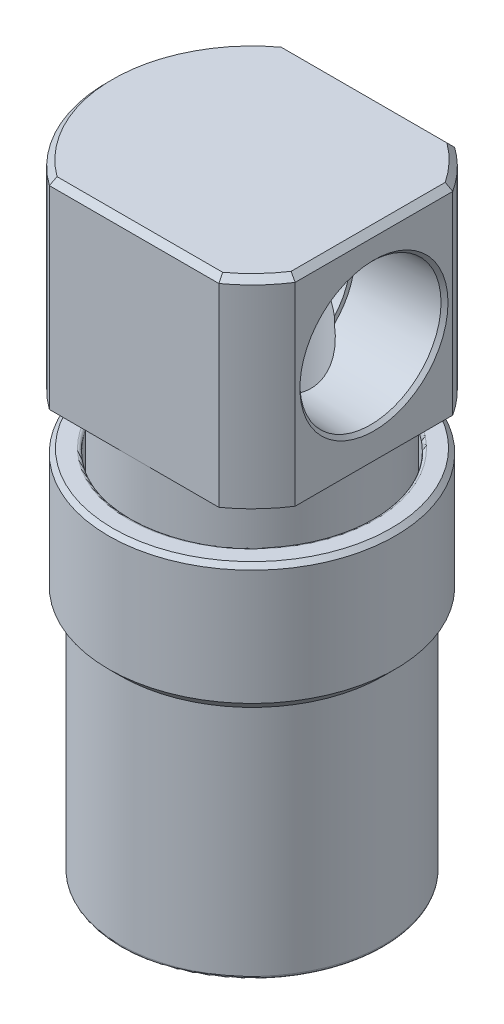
ISO-10303-21;
HEADER;
FILE_DESCRIPTION(('STEP AP214'),'2;1');
FILE_NAME('part.step','',(''),(''),'','','');
FILE_SCHEMA(('AUTOMOTIVE_DESIGN { 1 0 10303 214 1 1 1 1 }'));
ENDSEC;
DATA;
#1=APPLICATION_CONTEXT('core data for automotive mechanical design processes');
#2=APPLICATION_PROTOCOL_DEFINITION('international standard','automotive_design',2000,#1);
#3=PRODUCT_CONTEXT('',#1,'mechanical');
#4=PRODUCT('Part','Part','',(#3));
#5=PRODUCT_RELATED_PRODUCT_CATEGORY('part','',(#4));
#6=PRODUCT_DEFINITION_FORMATION('','',#4);
#7=PRODUCT_DEFINITION_CONTEXT('part definition',#1,'design');
#8=PRODUCT_DEFINITION('design','',#6,#7);
#9=PRODUCT_DEFINITION_SHAPE('','',#8);
#10=(LENGTH_UNIT() NAMED_UNIT(*) SI_UNIT(.MILLI.,.METRE.));
#11=(NAMED_UNIT(*) PLANE_ANGLE_UNIT() SI_UNIT($,.RADIAN.));
#12=(NAMED_UNIT(*) SI_UNIT($,.STERADIAN.) SOLID_ANGLE_UNIT());
#13=UNCERTAINTY_MEASURE_WITH_UNIT(LENGTH_MEASURE(1.E-05),#10,'distance_accuracy_value','');
#14=(GEOMETRIC_REPRESENTATION_CONTEXT(3) GLOBAL_UNCERTAINTY_ASSIGNED_CONTEXT((#13)) GLOBAL_UNIT_ASSIGNED_CONTEXT((#10,
#11,#12)) REPRESENTATION_CONTEXT('',''));
#15=CARTESIAN_POINT('',(0.,0.,0.));
#16=DIRECTION('',(0.,0.,1.));
#17=DIRECTION('',(1.,0.,0.));
#18=AXIS2_PLACEMENT_3D('',#15,#16,#17);
#19=CARTESIAN_POINT('',(0.,31.9644048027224,0.));
#20=DIRECTION('',(0.,1.,0.));
#21=DIRECTION('',(-1.,0.,0.));
#22=AXIS2_PLACEMENT_3D('',#19,#20,#21);
#23=CYLINDRICAL_SURFACE('',#22,5.1562);
#24=DIRECTION('',(0.,-1.,0.));
#25=VECTOR('',#24,1.);
#26=CARTESIAN_POINT('',(5.1562,31.9644048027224,0.));
#27=LINE('',#26,#25);
#28=CARTESIAN_POINT('',(5.1562,36.5125,0.));
#29=VERTEX_POINT('',#28);
#30=CARTESIAN_POINT('',(5.1562,20.2408096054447,0.));
#31=VERTEX_POINT('',#30);
#32=EDGE_CURVE('P0_E413',#29,#31,#27,.T.);
#33=ORIENTED_EDGE('',*,*,#32,.F.);
#34=ORIENTED_EDGE('',*,*,#32,.T.);
#35=CARTESIAN_POINT('',(0.,20.2408096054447,0.));
#36=DIRECTION('',(0.,1.,0.));
#37=DIRECTION('',(1.,0.,0.));
#38=AXIS2_PLACEMENT_3D('',#35,#36,#37);
#39=CIRCLE('',#38,5.1562);
#40=CARTESIAN_POINT('',(-5.1562,20.2408096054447,0.));
#41=VERTEX_POINT('',#40);
#42=EDGE_CURVE('P0_E412',#41,#31,#39,.T.);
#43=ORIENTED_EDGE('',*,*,#42,.F.);
#44=CARTESIAN_POINT('',(0.,20.2408096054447,0.));
#45=DIRECTION('',(0.,1.,0.));
#46=DIRECTION('',(1.,0.,0.));
#47=AXIS2_PLACEMENT_3D('',#44,#45,#46);
#48=CIRCLE('',#47,5.1562);
#49=EDGE_CURVE('P0_E479',#31,#41,#48,.T.);
#50=ORIENTED_EDGE('',*,*,#49,.F.);
#51=EDGE_LOOP('',(#33,#34,#43,#50));
#52=FACE_BOUND('',#51,.T.);
#53=DIRECTION('',(0.,-1.,0.));
#54=VECTOR('',#53,1.);
#55=CARTESIAN_POINT('',(3.048,44.45,4.15885734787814));
#56=LINE('',#55,#54);
#57=CARTESIAN_POINT('',(3.048,40.9846512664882,4.15885734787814));
#58=VERTEX_POINT('',#57);
#59=CARTESIAN_POINT('',(3.048,41.5496432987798,4.15885734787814));
#60=VERTEX_POINT('',#59);
#61=EDGE_CURVE('P0_E284',#58,#60,#56,.F.);
#62=ORIENTED_EDGE('',*,*,#61,.F.);
#63=CARTESIAN_POINT('',(3.0478,40.9848027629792,-4.1590039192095));
#64=CARTESIAN_POINT('',(3.16434102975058,40.896474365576,-4.07355942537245));
#65=CARTESIAN_POINT('',(3.27762787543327,40.8086720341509,-3.98304603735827));
#66=CARTESIAN_POINT('',(3.49735832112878,40.6354104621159,-3.79160225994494));
#67=CARTESIAN_POINT('',(3.60379124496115,40.5499549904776,-3.69065622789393));
#68=CARTESIAN_POINT('',(3.81004223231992,40.3822065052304,-3.47737473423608));
#69=CARTESIAN_POINT('',(3.90979238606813,40.2999487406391,-3.36494521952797));
#70=CARTESIAN_POINT('',(4.10065097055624,40.1409674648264,-3.12954405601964));
#71=CARTESIAN_POINT('',(4.19176481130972,40.0642404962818,-3.00657910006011));
#72=CARTESIAN_POINT('',(4.41096562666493,39.8782318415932,-2.68072947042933));
#73=CARTESIAN_POINT('',(4.53251418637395,39.7736910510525,-2.47048892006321));
#74=CARTESIAN_POINT('',(4.69357464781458,39.6341526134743,-2.13820163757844));
#75=CARTESIAN_POINT('',(4.74368074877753,39.5905513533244,-2.02473224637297));
#76=CARTESIAN_POINT('',(4.83620580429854,39.5097898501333,-1.79251380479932));
#77=CARTESIAN_POINT('',(4.87862878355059,39.47262623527,-1.67376755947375));
#78=CARTESIAN_POINT('',(4.95552199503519,39.4051105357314,-1.43027404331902));
#79=CARTESIAN_POINT('',(4.98989837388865,39.3748389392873,-1.30547465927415));
#80=CARTESIAN_POINT('',(5.04939946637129,39.3223577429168,-1.05208608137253));
#81=CARTESIAN_POINT('',(5.07452903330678,39.3001439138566,-0.923498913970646));
#82=CARTESIAN_POINT('',(5.11500898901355,39.2643266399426,-0.663608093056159));
#83=CARTESIAN_POINT('',(5.13035971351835,39.2507228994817,-0.532304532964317));
#84=CARTESIAN_POINT('',(5.15091627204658,39.2325000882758,-0.268293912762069));
#85=CARTESIAN_POINT('',(5.15612376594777,39.2278795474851,-0.135587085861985));
#86=CARTESIAN_POINT('',(5.15626339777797,39.2277555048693,0.110073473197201));
#87=CARTESIAN_POINT('',(5.15260845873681,39.2309983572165,0.223029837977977));
#88=CARTESIAN_POINT('',(5.13792855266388,39.2440141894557,0.448119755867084));
#89=CARTESIAN_POINT('',(5.12690135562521,39.253789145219,0.56025304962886));
#90=CARTESIAN_POINT('',(5.09767056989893,39.2796716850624,0.782774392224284));
#91=CARTESIAN_POINT('',(5.07947096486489,39.2957757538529,0.893163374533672));
#92=CARTESIAN_POINT('',(5.03619795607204,39.3340051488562,1.1115401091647));
#93=CARTESIAN_POINT('',(5.01112192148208,39.3561327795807,1.21952692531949));
#94=CARTESIAN_POINT('',(4.92709952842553,39.4301258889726,1.53520571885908));
#95=CARTESIAN_POINT('',(4.85881093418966,39.4900904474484,1.73861906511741));
#96=CARTESIAN_POINT('',(4.70041031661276,39.6282843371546,2.13008653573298));
#97=CARTESIAN_POINT('',(4.61028210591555,39.706527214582,2.3181291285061));
#98=CARTESIAN_POINT('',(4.43889668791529,39.8539799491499,2.6276884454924));
#99=CARTESIAN_POINT('',(4.36198788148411,39.9197801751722,2.75330441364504));
#100=CARTESIAN_POINT('',(4.19957044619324,40.0576294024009,2.99520084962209));
#101=CARTESIAN_POINT('',(4.11406134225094,40.1296787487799,3.11148080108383));
#102=CARTESIAN_POINT('',(3.93531810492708,40.2787812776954,3.33468738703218));
#103=CARTESIAN_POINT('',(3.84207657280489,40.3558392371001,3.44160485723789));
#104=CARTESIAN_POINT('',(3.6487105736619,40.513630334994,3.64596889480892));
#105=CARTESIAN_POINT('',(3.54858907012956,40.5943618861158,3.74341949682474));
#106=CARTESIAN_POINT('',(3.38132045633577,40.7270759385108,3.89364411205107));
#107=CARTESIAN_POINT('',(3.31613389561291,40.7783002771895,3.94930066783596));
#108=CARTESIAN_POINT('',(3.18360948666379,40.8812255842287,4.05688006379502));
#109=CARTESIAN_POINT('',(3.1162797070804,40.9329243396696,4.10881495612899));
#110=CARTESIAN_POINT('',(3.0478,40.9848027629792,4.1590039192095));
#111=B_SPLINE_CURVE_WITH_KNOTS('',3,(#63,#64,#65,#66,#67,#68,#69,#70,#71,#72,#73,#74,#75,#76,
#77,#78,#79,#80,#81,#82,#83,#84,#85,#86,#87,#88,#89,#90,#91,#92,#93,#94,#95,#96,#97,#98,#99,
#100,#101,#102,#103,#104,#105,#106,#107,#108,#109,#110),.UNSPECIFIED.,.F.,.F.,(4,2,2,2,2,2,2,2,
2,2,2,2,2,2,2,2,2,2,2,2,2,2,2,4),(0.,0.50804923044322,1.01687159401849,1.53025873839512,
2.04332212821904,2.83289694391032,3.22694729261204,3.62079062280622,4.01902115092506,
4.41704236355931,4.8150499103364,5.21299232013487,5.55175503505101,5.89062026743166,
6.22929755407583,6.5681045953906,7.23365488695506,7.89969999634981,8.3830419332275,
8.86641058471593,9.35024720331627,9.83387670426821,10.1333544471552,10.431813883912),.UNSPECIFIED.);
#112=CARTESIAN_POINT('',(3.048,40.9846512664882,-4.15885734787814));
#113=VERTEX_POINT('',#112);
#114=EDGE_CURVE('P0_E279',#113,#58,#111,.T.);
#115=ORIENTED_EDGE('',*,*,#114,.F.);
#116=DIRECTION('',(0.,-1.,0.));
#117=VECTOR('',#116,1.);
#118=CARTESIAN_POINT('',(3.048,44.45,-4.15885734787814));
#119=LINE('',#118,#117);
#120=CARTESIAN_POINT('',(3.048,41.5496432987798,-4.15885734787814));
#121=VERTEX_POINT('',#120);
#122=EDGE_CURVE('P0_E281',#121,#113,#119,.T.);
#123=ORIENTED_EDGE('',*,*,#122,.F.);
#124=CARTESIAN_POINT('',(3.048,41.5496432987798,4.15885734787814));
#125=CARTESIAN_POINT('',(2.99089821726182,41.5967537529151,4.20070379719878));
#126=CARTESIAN_POINT('',(2.93305306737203,41.6440640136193,4.24129403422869));
#127=CARTESIAN_POINT('',(2.81586216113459,41.7388946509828,4.31998901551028));
#128=CARTESIAN_POINT('',(2.75651638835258,41.7864150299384,4.35809373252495));
#129=CARTESIAN_POINT('',(2.57591353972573,41.9292393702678,4.4689000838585));
#130=CARTESIAN_POINT('',(2.452371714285,42.0245728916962,4.53788827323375));
#131=CARTESIAN_POINT('',(2.19617272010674,42.2152521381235,4.66736229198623));
#132=CARTESIAN_POINT('',(2.06337840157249,42.3105558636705,4.72763853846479));
#133=CARTESIAN_POINT('',(1.79017199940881,42.4958938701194,4.83770217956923));
#134=CARTESIAN_POINT('',(1.64977050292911,42.5859351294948,4.88750370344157));
#135=CARTESIAN_POINT('',(1.3834936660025,42.741643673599,4.96873977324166));
#136=CARTESIAN_POINT('',(1.25906282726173,42.8088780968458,5.00185015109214));
#137=CARTESIAN_POINT('',(1.00267565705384,42.9309970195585,5.05946850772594));
#138=CARTESIAN_POINT('',(0.870747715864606,42.9859246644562,5.08400671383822));
#139=CARTESIAN_POINT('',(0.622207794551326,43.0684187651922,5.11977964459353));
#140=CARTESIAN_POINT('',(0.506887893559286,43.0990729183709,5.1325803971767));
#141=CARTESIAN_POINT('',(0.272403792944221,43.1420431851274,5.15033254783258));
#142=CARTESIAN_POINT('',(0.153250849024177,43.1544087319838,5.15530510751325));
#143=CARTESIAN_POINT('',(-0.0859552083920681,43.15828470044,5.15687532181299));
#144=CARTESIAN_POINT('',(-0.206010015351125,43.1497112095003,5.15343927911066));
#145=CARTESIAN_POINT('',(-0.44278697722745,43.1134050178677,5.13853121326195));
#146=CARTESIAN_POINT('',(-0.559499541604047,43.0856220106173,5.12703808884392));
#147=CARTESIAN_POINT('',(-0.848314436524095,42.9970018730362,5.08900228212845));
#148=CARTESIAN_POINT('',(-1.01668177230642,42.9264347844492,5.05769919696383));
#149=CARTESIAN_POINT('',(-1.34128685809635,42.766850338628,4.98150292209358));
#150=CARTESIAN_POINT('',(-1.49746729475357,42.6777522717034,4.93654987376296));
#151=CARTESIAN_POINT('',(-1.80461670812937,42.4873203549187,4.8328848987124));
#152=CARTESIAN_POINT('',(-1.95526560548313,42.3856890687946,4.77378348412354));
#153=CARTESIAN_POINT('',(-2.24798113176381,42.1779807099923,4.64313271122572));
#154=CARTESIAN_POINT('',(-2.39003983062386,42.071899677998,4.57157208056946));
#155=CARTESIAN_POINT('',(-2.66643873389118,41.8587369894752,4.41606488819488));
#156=CARTESIAN_POINT('',(-2.80077810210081,41.7516552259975,4.33211698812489));
#157=CARTESIAN_POINT('',(-3.06187431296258,41.5389583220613,4.15168525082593));
#158=CARTESIAN_POINT('',(-3.18863472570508,41.4333425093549,4.05520738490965));
#159=CARTESIAN_POINT('',(-3.41818081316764,41.2391453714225,3.86287505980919));
#160=CARTESIAN_POINT('',(-3.52193060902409,41.1501464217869,3.76859788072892));
#161=CARTESIAN_POINT('',(-3.72294469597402,40.9759721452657,3.57016056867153));
#162=CARTESIAN_POINT('',(-3.82020837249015,40.8907971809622,3.46599950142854));
#163=CARTESIAN_POINT('',(-4.10082701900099,40.6431952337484,3.13878954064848));
#164=CARTESIAN_POINT('',(-4.27364546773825,40.4881453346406,2.90049028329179));
#165=CARTESIAN_POINT('',(-4.54405446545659,40.2435350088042,2.44733424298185));
#166=CARTESIAN_POINT('',(-4.64970891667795,40.1472293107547,2.24097314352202));
#167=CARTESIAN_POINT('',(-4.78837380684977,40.0203125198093,1.91618597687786));
#168=CARTESIAN_POINT('',(-4.83130295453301,39.9809209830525,1.80534564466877));
#169=CARTESIAN_POINT('',(-4.90991001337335,39.9086683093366,1.57908395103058));
#170=CARTESIAN_POINT('',(-4.94559106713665,39.8758043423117,1.46366460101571));
#171=CARTESIAN_POINT('',(-5.0093804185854,39.8169775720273,1.22782898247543));
#172=CARTESIAN_POINT('',(-5.03741682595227,39.7910803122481,1.10737679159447));
#173=CARTESIAN_POINT('',(-5.08490994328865,39.7471740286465,0.863433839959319));
#174=CARTESIAN_POINT('',(-5.10437106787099,39.729160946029,0.739944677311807));
#175=CARTESIAN_POINT('',(-5.13429859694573,39.7014480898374,0.491005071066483));
#176=CARTESIAN_POINT('',(-5.14476876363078,39.6917448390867,0.365555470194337));
#177=CARTESIAN_POINT('',(-5.15648119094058,39.6808898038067,0.113864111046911));
#178=CARTESIAN_POINT('',(-5.15772463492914,39.6797369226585,-0.0123775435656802));
#179=CARTESIAN_POINT('',(-5.15140808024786,39.6855915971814,-0.24772165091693));
#180=CARTESIAN_POINT('',(-5.14498984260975,39.6915407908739,-0.356884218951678));
#181=CARTESIAN_POINT('',(-5.12530142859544,39.7097802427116,-0.574088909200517));
#182=CARTESIAN_POINT('',(-5.11202914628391,39.7220724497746,-0.682130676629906));
#183=CARTESIAN_POINT('',(-5.07886033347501,39.7527662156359,-0.896275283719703));
#184=CARTESIAN_POINT('',(-5.05896583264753,39.7711659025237,-1.00237870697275));
#185=CARTESIAN_POINT('',(-5.01287280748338,39.8137465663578,-1.2120422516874));
#186=CARTESIAN_POINT('',(-4.98667175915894,39.8379298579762,-1.31560133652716));
#187=CARTESIAN_POINT('',(-4.89895119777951,39.9187787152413,-1.62231769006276));
#188=CARTESIAN_POINT('',(-4.8284212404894,39.9836438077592,-1.8208431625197));
#189=CARTESIAN_POINT('',(-4.66695519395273,40.131457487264,-2.20201902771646));
#190=CARTESIAN_POINT('',(-4.5760140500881,40.2144105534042,-2.38466547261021));
#191=CARTESIAN_POINT('',(-4.40262288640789,40.3715600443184,-2.68803590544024));
#192=CARTESIAN_POINT('',(-4.32396073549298,40.4425602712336,-2.81264073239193));
#193=CARTESIAN_POINT('',(-4.15839882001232,40.5911095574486,-3.05209882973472));
#194=CARTESIAN_POINT('',(-4.07149806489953,40.6686594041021,-3.16695092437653));
#195=CARTESIAN_POINT('',(-3.89018566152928,40.8292416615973,-3.38722226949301));
#196=CARTESIAN_POINT('',(-3.79575041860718,40.9122911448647,-3.49260950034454));
#197=CARTESIAN_POINT('',(-3.60042091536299,41.0823982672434,-3.69364427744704));
#198=CARTESIAN_POINT('',(-3.49952732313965,41.1694554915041,-3.78929282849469));
#199=CARTESIAN_POINT('',(-3.26527422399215,41.3690308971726,-3.99429919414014));
#200=CARTESIAN_POINT('',(-3.13020784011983,41.4823694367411,-4.10091243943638));
#201=CARTESIAN_POINT('',(-2.85124346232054,41.7111439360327,-4.29955386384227));
#202=CARTESIAN_POINT('',(-2.70733939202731,41.8265812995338,-4.39157184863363));
#203=CARTESIAN_POINT('',(-2.41098087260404,42.0562473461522,-4.56099155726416));
#204=CARTESIAN_POINT('',(-2.25854950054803,42.1704783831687,-4.63843046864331));
#205=CARTESIAN_POINT('',(-1.94379604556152,42.3938307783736,-4.77888791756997));
#206=CARTESIAN_POINT('',(-1.7814865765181,42.5029583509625,-4.84192437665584));
#207=CARTESIAN_POINT('',(-1.48915392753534,42.6816867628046,-4.93819555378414));
#208=CARTESIAN_POINT('',(-1.36200704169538,42.7540871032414,-4.97489869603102));
#209=CARTESIAN_POINT('',(-1.09955980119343,42.8874049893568,-5.03940519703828));
#210=CARTESIAN_POINT('',(-0.964267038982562,42.9483330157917,-5.06721669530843));
#211=CARTESIAN_POINT('',(-0.709926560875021,43.0417429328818,-5.10840805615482));
#212=CARTESIAN_POINT('',(-0.592356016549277,43.0773746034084,-5.12348692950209));
#213=CARTESIAN_POINT('',(-0.35256610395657,43.13024709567,-5.14553038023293));
#214=CARTESIAN_POINT('',(-0.230363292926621,43.147548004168,-5.15252147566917));
#215=CARTESIAN_POINT('',(0.016309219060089,43.1602031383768,-5.15765674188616));
#216=CARTESIAN_POINT('',(0.140788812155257,43.1554024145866,-5.15573845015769));
#217=CARTESIAN_POINT('',(0.386743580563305,43.1246314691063,-5.14315973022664));
#218=CARTESIAN_POINT('',(0.508210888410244,43.0986108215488,-5.13247847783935));
#219=CARTESIAN_POINT('',(0.795384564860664,43.0160819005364,-5.09732207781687));
#220=CARTESIAN_POINT('',(0.958132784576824,42.9513423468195,-5.06892842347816));
#221=CARTESIAN_POINT('',(1.27284689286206,42.8031091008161,-4.99925547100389));
#222=CARTESIAN_POINT('',(1.42471377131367,42.7194664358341,-4.95787274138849));
#223=CARTESIAN_POINT('',(1.71054465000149,42.5474714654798,-4.86637440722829));
#224=CARTESIAN_POINT('',(1.8450351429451,42.459648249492,-4.81688051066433));
#225=CARTESIAN_POINT('',(2.10704371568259,42.279512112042,-4.70817416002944));
#226=CARTESIAN_POINT('',(2.23455464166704,42.1871947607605,-4.64895197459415));
#227=CARTESIAN_POINT('',(2.47956376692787,42.0036882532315,-4.52289084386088));
#228=CARTESIAN_POINT('',(2.59724880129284,41.912550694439,-4.45633962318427));
#229=CARTESIAN_POINT('',(2.76950787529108,41.7760299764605,-4.34980071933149));
#230=CARTESIAN_POINT('',(2.82616524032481,41.730596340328,-4.31320636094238));
#231=CARTESIAN_POINT('',(2.93810859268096,41.6399285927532,-4.23774334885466));
#232=CARTESIAN_POINT('',(2.99339457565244,41.5946944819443,-4.19887468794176));
#233=CARTESIAN_POINT('',(3.04799999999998,41.5496432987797,-4.15885734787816));
#234=B_SPLINE_CURVE_WITH_KNOTS('',3,(#124,#125,#126,#127,#128,#129,#130,#131,#132,#133,#134,
#135,#136,#137,#138,#139,#140,#141,#142,#143,#144,#145,#146,#147,#148,#149,#150,#151,#152,#153,
#154,#155,#156,#157,#158,#159,#160,#161,#162,#163,#164,#165,#166,#167,#168,#169,#170,#171,#172,
#173,#174,#175,#176,#177,#178,#179,#180,#181,#182,#183,#184,#185,#186,#187,#188,#189,#190,#191,
#192,#193,#194,#195,#196,#197,#198,#199,#200,#201,#202,#203,#204,#205,#206,#207,#208,#209,#210,
#211,#212,#213,#214,#215,#216,#217,#218,#219,#220,#221,#222,#223,#224,#225,#226,#227,#228,#229,
#230,#231,#232,#233),.UNSPECIFIED.,.F.,.F.,(4,2,2,2,2,2,2,2,2,2,2,2,2,2,2,2,2,2,2,2,2,2,2,2,2,2,
2,2,2,2,2,2,2,2,2,2,2,2,2,2,2,2,2,2,2,2,2,2,2,2,2,2,2,2,4),(0.,0.255079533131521,
0.510161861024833,1.02158145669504,1.54376820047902,2.06524598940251,2.50037109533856,
2.93394599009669,3.29260873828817,3.65030025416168,4.00942755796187,4.36949893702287,
4.92201384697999,5.47698755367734,6.04947787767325,6.62248887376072,7.1955618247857,
7.76836266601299,8.26605020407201,8.76378483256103,9.75631989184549,10.5063745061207,
10.8816364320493,11.2567353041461,11.6352486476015,12.0135669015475,12.3917267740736,
12.7698381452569,13.0979775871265,13.4262179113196,13.7543577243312,14.0826290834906,
14.7412079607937,15.3999501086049,15.8900252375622,16.3801593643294,16.871893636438,
17.3635771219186,17.9809322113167,18.5987166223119,19.2149032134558,19.8303188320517,
20.2822609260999,20.7337881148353,21.1037934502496,21.4725821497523,21.8439602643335,
22.21622348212,22.7455539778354,23.2792112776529,23.7828684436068,24.2870325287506,
24.775805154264,25.0197363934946,25.2636684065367),.UNSPECIFIED.);
#235=EDGE_CURVE('P0_E297',#60,#121,#234,.T.);
#236=ORIENTED_EDGE('',*,*,#235,.F.);
#237=EDGE_LOOP('',(#62,#115,#123,#236));
#238=FACE_BOUND('',#237,.T.);
#239=ADVANCED_FACE('P0_F50',(#52,#238),#23,.F.);
#240=CARTESIAN_POINT('',(0.,28.575,0.));
#241=DIRECTION('',(0.,1.,0.));
#242=DIRECTION('',(0.,0.,1.));
#243=AXIS2_PLACEMENT_3D('',#240,#241,#242);
#244=CYLINDRICAL_SURFACE('',#243,10.3124);
#245=CARTESIAN_POINT('',(0.,28.575,0.));
#246=DIRECTION('',(0.,1.,0.));
#247=DIRECTION('',(0.,0.,1.));
#248=AXIS2_PLACEMENT_3D('',#245,#246,#247);
#249=CIRCLE('',#248,10.3124);
#250=CARTESIAN_POINT('',(0.,28.575,10.3124));
#251=VERTEX_POINT('',#250);
#252=EDGE_CURVE('P0_E335',#251,#251,#249,.T.);
#253=ORIENTED_EDGE('',*,*,#252,.T.);
#254=EDGE_LOOP('',(#253));
#255=FACE_BOUND('',#254,.T.);
#256=CARTESIAN_POINT('',(0.,36.5125,0.));
#257=DIRECTION('',(0.,1.,0.));
#258=DIRECTION('',(0.,0.,1.));
#259=AXIS2_PLACEMENT_3D('',#256,#257,#258);
#260=CIRCLE('',#259,10.3124);
#261=CARTESIAN_POINT('',(0.,36.5125,-10.3124));
#262=VERTEX_POINT('',#261);
#263=CARTESIAN_POINT('',(0.,36.5125,10.3124));
#264=VERTEX_POINT('',#263);
#265=EDGE_CURVE('P0_E503',#262,#264,#260,.F.);
#266=ORIENTED_EDGE('',*,*,#265,.T.);
#267=EDGE_CURVE('P0_E289',#264,#262,#260,.F.);
#268=ORIENTED_EDGE('',*,*,#267,.T.);
#269=EDGE_LOOP('',(#266,#268));
#270=FACE_BOUND('',#269,.T.);
#271=ADVANCED_FACE('P0_F588',(#255,#270),#244,.T.);
#272=CARTESIAN_POINT('',(0.,35.8775,0.));
#273=DIRECTION('',(0.,1.,0.));
#274=DIRECTION('',(-1.,0.,0.));
#275=AXIS2_PLACEMENT_3D('',#272,#273,#274);
#276=CYLINDRICAL_SURFACE('',#275,10.4902);
#277=DIRECTION('',(0.,-1.,0.));
#278=VECTOR('',#277,1.);
#279=CARTESIAN_POINT('',(10.4902,35.8775,0.));
#280=LINE('',#279,#278);
#281=CARTESIAN_POINT('',(10.4902,28.575,0.));
#282=VERTEX_POINT('',#281);
#283=CARTESIAN_POINT('',(10.4902,18.288,0.));
#284=VERTEX_POINT('',#283);
#285=EDGE_CURVE('P0_E403',#282,#284,#280,.T.);
#286=ORIENTED_EDGE('',*,*,#285,.F.);
#287=CARTESIAN_POINT('',(0.,28.575,0.));
#288=DIRECTION('',(0.,1.,0.));
#289=DIRECTION('',(0.,0.,1.));
#290=AXIS2_PLACEMENT_3D('',#287,#288,#289);
#291=CIRCLE('',#290,10.4902);
#292=EDGE_CURVE('P0_E349',#282,#282,#291,.F.);
#293=ORIENTED_EDGE('',*,*,#292,.T.);
#294=ORIENTED_EDGE('',*,*,#285,.T.);
#295=CARTESIAN_POINT('',(0.,18.288,0.));
#296=DIRECTION('',(0.,-1.,0.));
#297=DIRECTION('',(1.,0.,0.));
#298=AXIS2_PLACEMENT_3D('',#295,#296,#297);
#299=CIRCLE('',#298,10.4902);
#300=CARTESIAN_POINT('',(-10.4902,18.288,0.));
#301=VERTEX_POINT('',#300);
#302=EDGE_CURVE('P0_E373',#301,#284,#299,.T.);
#303=ORIENTED_EDGE('',*,*,#302,.F.);
#304=CARTESIAN_POINT('',(0.,18.288,0.));
#305=DIRECTION('',(0.,-1.,0.));
#306=DIRECTION('',(1.,0.,0.));
#307=AXIS2_PLACEMENT_3D('',#304,#305,#306);
#308=CIRCLE('',#307,10.4902);
#309=EDGE_CURVE('P0_E398',#284,#301,#308,.T.);
#310=ORIENTED_EDGE('',*,*,#309,.F.);
#311=EDGE_LOOP('',(#286,#293,#294,#303,#310));
#312=FACE_BOUND('',#311,.T.);
#313=ADVANCED_FACE('P0_F591',(#312),#276,.T.);
#314=CARTESIAN_POINT('',(0.,0.508,0.));
#315=DIRECTION('',(0.,-1.,0.));
#316=DIRECTION('',(1.,0.,0.));
#317=AXIS2_PLACEMENT_3D('',#314,#315,#316);
#318=CONICAL_SURFACE('',#317,7.2517,0.785398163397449);
#319=CARTESIAN_POINT('',(0.,0.,0.));
#320=DIRECTION('',(0.,-1.,0.));
#321=DIRECTION('',(1.,0.,0.));
#322=AXIS2_PLACEMENT_3D('',#319,#320,#321);
#323=CIRCLE('',#322,7.7597);
#324=CARTESIAN_POINT('',(-7.7597,0.,0.));
#325=VERTEX_POINT('',#324);
#326=EDGE_CURVE('P0_E360',#325,#325,#323,.T.);
#327=ORIENTED_EDGE('',*,*,#326,.T.);
#328=DIRECTION('',(0.707106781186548,0.707106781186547,0.));
#329=VECTOR('',#328,1.);
#330=CARTESIAN_POINT('',(-7.2517,0.508,0.));
#331=LINE('',#330,#329);
#332=CARTESIAN_POINT('',(-6.7437,1.016,0.));
#333=VERTEX_POINT('',#332);
#334=EDGE_CURVE('P0_E356',#325,#333,#331,.T.);
#335=ORIENTED_EDGE('',*,*,#334,.T.);
#336=CARTESIAN_POINT('',(0.,1.016,0.));
#337=DIRECTION('',(0.,1.,0.));
#338=DIRECTION('',(1.,0.,0.));
#339=AXIS2_PLACEMENT_3D('',#336,#337,#338);
#340=CIRCLE('',#339,6.7437);
#341=CARTESIAN_POINT('',(6.7437,1.016,0.));
#342=VERTEX_POINT('',#341);
#343=EDGE_CURVE('P0_E361',#333,#342,#340,.T.);
#344=ORIENTED_EDGE('',*,*,#343,.T.);
#345=CARTESIAN_POINT('',(0.,1.016,0.));
#346=DIRECTION('',(0.,1.,0.));
#347=DIRECTION('',(1.,0.,0.));
#348=AXIS2_PLACEMENT_3D('',#345,#346,#347);
#349=CIRCLE('',#348,6.7437);
#350=EDGE_CURVE('P0_E469',#342,#333,#349,.T.);
#351=ORIENTED_EDGE('',*,*,#350,.T.);
#352=ORIENTED_EDGE('',*,*,#334,.F.);
#353=EDGE_LOOP('',(#327,#335,#344,#351,#352));
#354=FACE_BOUND('',#353,.T.);
#355=ADVANCED_FACE('P0_F620',(#354),#318,.F.);
#356=CARTESIAN_POINT('',(-8.9535,0.,0.));
#357=DIRECTION('',(0.,-1.,0.));
#358=DIRECTION('',(0.,0.,-1.));
#359=AXIS2_PLACEMENT_3D('',#356,#357,#358);
#360=PLANE('',#359);
#361=CARTESIAN_POINT('',(0.,0.,0.));
#362=DIRECTION('',(0.,1.,0.));
#363=DIRECTION('',(1.,0.,0.));
#364=AXIS2_PLACEMENT_3D('',#361,#362,#363);
#365=CIRCLE('',#364,8.6995);
#366=CARTESIAN_POINT('',(-8.6995,0.,0.));
#367=VERTEX_POINT('',#366);
#368=CARTESIAN_POINT('',(8.6995,0.,0.));
#369=VERTEX_POINT('',#368);
#370=EDGE_CURVE('P0_E368',#367,#369,#365,.T.);
#371=ORIENTED_EDGE('',*,*,#370,.F.);
#372=CARTESIAN_POINT('',(0.,0.,0.));
#373=DIRECTION('',(0.,1.,0.));
#374=DIRECTION('',(1.,0.,0.));
#375=AXIS2_PLACEMENT_3D('',#372,#373,#374);
#376=CIRCLE('',#375,8.6995);
#377=EDGE_CURVE('P0_E371',#369,#367,#376,.T.);
#378=ORIENTED_EDGE('',*,*,#377,.F.);
#379=EDGE_LOOP('',(#371,#378));
#380=FACE_BOUND('',#379,.T.);
#381=ORIENTED_EDGE('',*,*,#326,.F.);
#382=EDGE_LOOP('',(#381));
#383=FACE_BOUND('',#382,.T.);
#384=ADVANCED_FACE('P0_F616',(#380,#383),#360,.T.);
#385=CARTESIAN_POINT('',(0.,6.5396999,0.));
#386=DIRECTION('',(0.,1.,0.));
#387=DIRECTION('',(-1.,0.,0.));
#388=AXIS2_PLACEMENT_3D('',#385,#386,#387);
#389=CYLINDRICAL_SURFACE('',#388,6.7437);
#390=CARTESIAN_POINT('',(0.,13.0793998,0.));
#391=DIRECTION('',(0.,1.,0.));
#392=DIRECTION('',(0.,0.,1.));
#393=AXIS2_PLACEMENT_3D('',#390,#391,#392);
#394=CIRCLE('',#393,6.7437);
#395=CARTESIAN_POINT('',(-6.7437,13.0793998,0.));
#396=VERTEX_POINT('',#395);
#397=CARTESIAN_POINT('',(6.7437,13.0793998,0.));
#398=VERTEX_POINT('',#397);
#399=EDGE_CURVE('P0_E465',#396,#398,#394,.T.);
#400=ORIENTED_EDGE('',*,*,#399,.T.);
#401=DIRECTION('',(0.,-1.,0.));
#402=VECTOR('',#401,1.);
#403=CARTESIAN_POINT('',(6.7437,6.5396999,0.));
#404=LINE('',#403,#402);
#405=EDGE_CURVE('P0_E470',#398,#342,#404,.T.);
#406=ORIENTED_EDGE('',*,*,#405,.T.);
#407=ORIENTED_EDGE('',*,*,#343,.F.);
#408=ORIENTED_EDGE('',*,*,#350,.F.);
#409=ORIENTED_EDGE('',*,*,#405,.F.);
#410=CARTESIAN_POINT('',(0.,13.0793998,0.));
#411=DIRECTION('',(0.,1.,0.));
#412=DIRECTION('',(0.,0.,1.));
#413=AXIS2_PLACEMENT_3D('',#410,#411,#412);
#414=CIRCLE('',#413,6.7437);
#415=EDGE_CURVE('P0_E354',#398,#396,#414,.T.);
#416=ORIENTED_EDGE('',*,*,#415,.T.);
#417=EDGE_LOOP('',(#400,#406,#407,#408,#409,#416));
#418=FACE_BOUND('',#417,.T.);
#419=ADVANCED_FACE('P0_F619',(#418),#389,.F.);
#420=CARTESIAN_POINT('',(0.,20.2408096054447,0.));
#421=DIRECTION('',(0.,1.,0.));
#422=DIRECTION('',(-1.,0.,0.));
#423=AXIS2_PLACEMENT_3D('',#420,#421,#422);
#424=TOROIDAL_SURFACE('',#423,5.4102,0.254);
#425=CARTESIAN_POINT('',(0.,19.9868096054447,0.));
#426=DIRECTION('',(0.,-1.,0.));
#427=DIRECTION('',(1.,0.,0.));
#428=AXIS2_PLACEMENT_3D('',#425,#426,#427);
#429=CIRCLE('',#428,5.4102);
#430=CARTESIAN_POINT('',(-5.4102,19.9868096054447,0.));
#431=VERTEX_POINT('',#430);
#432=CARTESIAN_POINT('',(5.4102,19.9868096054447,0.));
#433=VERTEX_POINT('',#432);
#434=EDGE_CURVE('P0_E350',#431,#433,#429,.T.);
#435=ORIENTED_EDGE('',*,*,#434,.T.);
#436=CARTESIAN_POINT('',(5.4102,20.2408096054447,0.));
#437=DIRECTION('',(0.,0.,-1.));
#438=DIRECTION('',(1.,0.,0.));
#439=AXIS2_PLACEMENT_3D('',#436,#437,#438);
#440=CIRCLE('',#439,0.254);
#441=EDGE_CURVE('P0_E355',#433,#31,#440,.T.);
#442=ORIENTED_EDGE('',*,*,#441,.T.);
#443=ORIENTED_EDGE('',*,*,#49,.T.);
#444=ORIENTED_EDGE('',*,*,#42,.T.);
#445=ORIENTED_EDGE('',*,*,#441,.F.);
#446=CARTESIAN_POINT('',(0.,19.9868096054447,0.));
#447=DIRECTION('',(0.,-1.,0.));
#448=DIRECTION('',(1.,0.,0.));
#449=AXIS2_PLACEMENT_3D('',#446,#447,#448);
#450=CIRCLE('',#449,5.4102);
#451=EDGE_CURVE('P0_E408',#433,#431,#450,.T.);
#452=ORIENTED_EDGE('',*,*,#451,.T.);
#453=EDGE_LOOP('',(#435,#442,#443,#444,#445,#452));
#454=FACE_BOUND('',#453,.T.);
#455=ADVANCED_FACE('P0_F624',(#454),#424,.T.);
#456=CARTESIAN_POINT('',(-7.12675285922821,19.9868096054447,0.));
#457=DIRECTION('',(0.,-1.,0.));
#458=DIRECTION('',(0.,0.,-1.));
#459=AXIS2_PLACEMENT_3D('',#456,#457,#458);
#460=PLANE('',#459);
#461=CARTESIAN_POINT('',(0.,19.9868096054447,0.));
#462=DIRECTION('',(0.,1.,0.));
#463=DIRECTION('',(0.,0.,1.));
#464=AXIS2_PLACEMENT_3D('',#461,#462,#463);
#465=CIRCLE('',#464,7.12675285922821);
#466=CARTESIAN_POINT('',(-7.12675285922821,19.9868096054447,0.));
#467=VERTEX_POINT('',#466);
#468=CARTESIAN_POINT('',(7.12675285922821,19.9868096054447,0.));
#469=VERTEX_POINT('',#468);
#470=EDGE_CURVE('P0_E391',#467,#469,#465,.T.);
#471=ORIENTED_EDGE('',*,*,#470,.F.);
#472=CARTESIAN_POINT('',(0.,19.9868096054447,0.));
#473=DIRECTION('',(0.,1.,0.));
#474=DIRECTION('',(0.,0.,1.));
#475=AXIS2_PLACEMENT_3D('',#472,#473,#474);
#476=CIRCLE('',#475,7.12675285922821);
#477=EDGE_CURVE('P0_E362',#469,#467,#476,.T.);
#478=ORIENTED_EDGE('',*,*,#477,.F.);
#479=EDGE_LOOP('',(#471,#478));
#480=FACE_BOUND('',#479,.T.);
#481=ORIENTED_EDGE('',*,*,#434,.F.);
#482=ORIENTED_EDGE('',*,*,#451,.F.);
#483=EDGE_LOOP('',(#481,#482));
#484=FACE_BOUND('',#483,.T.);
#485=ADVANCED_FACE('P0_F631',(#480,#484),#460,.T.);
#486=CARTESIAN_POINT('',(0.,0.254,0.));
#487=DIRECTION('',(0.,1.,0.));
#488=DIRECTION('',(-1.,0.,0.));
#489=AXIS2_PLACEMENT_3D('',#486,#487,#488);
#490=TOROIDAL_SURFACE('',#489,8.6995,0.254);
#491=CARTESIAN_POINT('',(0.,0.254,0.));
#492=DIRECTION('',(0.,-1.,0.));
#493=DIRECTION('',(1.,0.,0.));
#494=AXIS2_PLACEMENT_3D('',#491,#492,#493);
#495=CIRCLE('',#494,8.9535);
#496=CARTESIAN_POINT('',(-8.9535,0.254,0.));
#497=VERTEX_POINT('',#496);
#498=CARTESIAN_POINT('',(8.9535,0.254,0.));
#499=VERTEX_POINT('',#498);
#500=EDGE_CURVE('P0_E440',#497,#499,#495,.T.);
#501=ORIENTED_EDGE('',*,*,#500,.T.);
#502=CARTESIAN_POINT('',(8.6995,0.254,0.));
#503=DIRECTION('',(0.,0.,-1.));
#504=DIRECTION('',(1.,0.,0.));
#505=AXIS2_PLACEMENT_3D('',#502,#503,#504);
#506=CIRCLE('',#505,0.254);
#507=EDGE_CURVE('P0_E439',#499,#369,#506,.T.);
#508=ORIENTED_EDGE('',*,*,#507,.T.);
#509=ORIENTED_EDGE('',*,*,#377,.T.);
#510=ORIENTED_EDGE('',*,*,#370,.T.);
#511=ORIENTED_EDGE('',*,*,#507,.F.);
#512=CARTESIAN_POINT('',(0.,0.254,0.));
#513=DIRECTION('',(0.,-1.,0.));
#514=DIRECTION('',(1.,0.,0.));
#515=AXIS2_PLACEMENT_3D('',#512,#513,#514);
#516=CIRCLE('',#515,8.9535);
#517=EDGE_CURVE('P0_E372',#499,#497,#516,.T.);
#518=ORIENTED_EDGE('',*,*,#517,.T.);
#519=EDGE_LOOP('',(#501,#508,#509,#510,#511,#518));
#520=FACE_BOUND('',#519,.T.);
#521=ADVANCED_FACE('P0_F604',(#520),#490,.T.);
#522=CARTESIAN_POINT('',(0.,8.89,0.));
#523=DIRECTION('',(0.,1.,0.));
#524=DIRECTION('',(-1.,0.,0.));
#525=AXIS2_PLACEMENT_3D('',#522,#523,#524);
#526=CYLINDRICAL_SURFACE('',#525,8.9535);
#527=CARTESIAN_POINT('',(0.,17.78,0.));
#528=DIRECTION('',(0.,1.,0.));
#529=DIRECTION('',(0.,0.,1.));
#530=AXIS2_PLACEMENT_3D('',#527,#528,#529);
#531=CIRCLE('',#530,8.9535);
#532=CARTESIAN_POINT('',(-8.9535,17.78,0.));
#533=VERTEX_POINT('',#532);
#534=CARTESIAN_POINT('',(8.9535,17.78,0.));
#535=VERTEX_POINT('',#534);
#536=EDGE_CURVE('P0_E453',#533,#535,#531,.T.);
#537=ORIENTED_EDGE('',*,*,#536,.F.);
#538=CARTESIAN_POINT('',(0.,17.78,0.));
#539=DIRECTION('',(0.,1.,0.));
#540=DIRECTION('',(0.,0.,1.));
#541=AXIS2_PLACEMENT_3D('',#538,#539,#540);
#542=CIRCLE('',#541,8.9535);
#543=EDGE_CURVE('P0_E435',#535,#533,#542,.T.);
#544=ORIENTED_EDGE('',*,*,#543,.F.);
#545=DIRECTION('',(0.,-1.,0.));
#546=VECTOR('',#545,1.);
#547=CARTESIAN_POINT('',(8.9535,8.89,0.));
#548=LINE('',#547,#546);
#549=EDGE_CURVE('P0_E377',#535,#499,#548,.T.);
#550=ORIENTED_EDGE('',*,*,#549,.T.);
#551=ORIENTED_EDGE('',*,*,#500,.F.);
#552=ORIENTED_EDGE('',*,*,#517,.F.);
#553=ORIENTED_EDGE('',*,*,#549,.F.);
#554=EDGE_LOOP('',(#537,#544,#550,#551,#552,#553));
#555=FACE_BOUND('',#554,.T.);
#556=ADVANCED_FACE('P0_F600',(#555),#526,.T.);
#557=CARTESIAN_POINT('',(0.,18.288,0.));
#558=DIRECTION('',(0.,1.,0.));
#559=DIRECTION('',(-1.,0.,0.));
#560=AXIS2_PLACEMENT_3D('',#557,#558,#559);
#561=TOROIDAL_SURFACE('',#560,9.9822,0.508);
#562=ORIENTED_EDGE('',*,*,#302,.T.);
#563=CARTESIAN_POINT('',(9.9822,18.288,0.));
#564=DIRECTION('',(0.,0.,-1.));
#565=DIRECTION('',(1.,0.,0.));
#566=AXIS2_PLACEMENT_3D('',#563,#564,#565);
#567=CIRCLE('',#566,0.508);
#568=CARTESIAN_POINT('',(9.9822,17.78,0.));
#569=VERTEX_POINT('',#568);
#570=EDGE_CURVE('P0_E378',#284,#569,#567,.T.);
#571=ORIENTED_EDGE('',*,*,#570,.T.);
#572=CARTESIAN_POINT('',(0.,17.78,0.));
#573=DIRECTION('',(0.,1.,0.));
#574=DIRECTION('',(1.,0.,0.));
#575=AXIS2_PLACEMENT_3D('',#572,#573,#574);
#576=CIRCLE('',#575,9.9822);
#577=CARTESIAN_POINT('',(-9.9822,17.78,0.));
#578=VERTEX_POINT('',#577);
#579=EDGE_CURVE('P0_E407',#569,#578,#576,.T.);
#580=ORIENTED_EDGE('',*,*,#579,.T.);
#581=CARTESIAN_POINT('',(0.,17.78,0.));
#582=DIRECTION('',(0.,1.,0.));
#583=DIRECTION('',(1.,0.,0.));
#584=AXIS2_PLACEMENT_3D('',#581,#582,#583);
#585=CIRCLE('',#584,9.9822);
#586=EDGE_CURVE('P0_E402',#578,#569,#585,.T.);
#587=ORIENTED_EDGE('',*,*,#586,.T.);
#588=ORIENTED_EDGE('',*,*,#570,.F.);
#589=ORIENTED_EDGE('',*,*,#309,.T.);
#590=EDGE_LOOP('',(#562,#571,#580,#587,#588,#589));
#591=FACE_BOUND('',#590,.T.);
#592=ADVANCED_FACE('P0_F603',(#591),#561,.T.);
#593=CARTESIAN_POINT('',(-10.4902,17.78,0.));
#594=DIRECTION('',(0.,-1.,0.));
#595=DIRECTION('',(0.,0.,-1.));
#596=AXIS2_PLACEMENT_3D('',#593,#594,#595);
#597=PLANE('',#596);
#598=ORIENTED_EDGE('',*,*,#586,.F.);
#599=ORIENTED_EDGE('',*,*,#579,.F.);
#600=EDGE_LOOP('',(#598,#599));
#601=FACE_BOUND('',#600,.T.);
#602=ORIENTED_EDGE('',*,*,#536,.T.);
#603=ORIENTED_EDGE('',*,*,#543,.T.);
#604=EDGE_LOOP('',(#602,#603));
#605=FACE_BOUND('',#604,.T.);
#606=ADVANCED_FACE('P0_F608',(#601,#605),#597,.T.);
#607=CARTESIAN_POINT('',(0.,18.9252928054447,0.));
#608=DIRECTION('',(0.,1.,0.));
#609=DIRECTION('',(-1.,0.,0.));
#610=AXIS2_PLACEMENT_3D('',#607,#608,#609);
#611=CYLINDRICAL_SURFACE('',#610,7.12675285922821);
#612=ORIENTED_EDGE('',*,*,#470,.T.);
#613=DIRECTION('',(0.,-1.,0.));
#614=VECTOR('',#613,1.);
#615=CARTESIAN_POINT('',(7.12675285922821,18.9252928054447,0.));
#616=LINE('',#615,#614);
#617=CARTESIAN_POINT('',(7.12675285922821,17.8637760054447,0.));
#618=VERTEX_POINT('',#617);
#619=EDGE_CURVE('P0_E366',#469,#618,#616,.T.);
#620=ORIENTED_EDGE('',*,*,#619,.T.);
#621=CARTESIAN_POINT('',(0.,17.8637760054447,0.));
#622=DIRECTION('',(0.,1.,0.));
#623=DIRECTION('',(0.,0.,1.));
#624=AXIS2_PLACEMENT_3D('',#621,#622,#623);
#625=CIRCLE('',#624,7.12675285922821);
#626=CARTESIAN_POINT('',(-7.12675285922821,17.8637760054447,0.));
#627=VERTEX_POINT('',#626);
#628=EDGE_CURVE('P0_E367',#627,#618,#625,.T.);
#629=ORIENTED_EDGE('',*,*,#628,.F.);
#630=CARTESIAN_POINT('',(0.,17.8637760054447,0.));
#631=DIRECTION('',(0.,1.,0.));
#632=DIRECTION('',(0.,0.,1.));
#633=AXIS2_PLACEMENT_3D('',#630,#631,#632);
#634=CIRCLE('',#633,7.12675285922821);
#635=EDGE_CURVE('P0_E431',#618,#627,#634,.T.);
#636=ORIENTED_EDGE('',*,*,#635,.F.);
#637=ORIENTED_EDGE('',*,*,#619,.F.);
#638=ORIENTED_EDGE('',*,*,#477,.T.);
#639=EDGE_LOOP('',(#612,#620,#629,#636,#637,#638));
#640=FACE_BOUND('',#639,.T.);
#641=ADVANCED_FACE('P0_F636',(#640),#611,.F.);
#642=CARTESIAN_POINT('',(0.,17.7964660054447,0.));
#643=DIRECTION('',(0.,-1.,0.));
#644=DIRECTION('',(-1.,0.,0.));
#645=AXIS2_PLACEMENT_3D('',#642,#643,#644);
#646=CONICAL_SURFACE('',#645,7.24333719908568,1.0471975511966);
#647=ORIENTED_EDGE('',*,*,#628,.T.);
#648=DIRECTION('',(0.866025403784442,-0.499999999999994,0.));
#649=VECTOR('',#648,1.);
#650=CARTESIAN_POINT('',(7.24333719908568,17.7964660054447,0.));
#651=LINE('',#650,#649);
#652=CARTESIAN_POINT('',(7.35992153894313,17.7291560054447,0.));
#653=VERTEX_POINT('',#652);
#654=EDGE_CURVE('P0_E427',#618,#653,#651,.T.);
#655=ORIENTED_EDGE('',*,*,#654,.T.);
#656=CARTESIAN_POINT('',(0.,17.7291560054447,0.));
#657=DIRECTION('',(0.,1.,0.));
#658=DIRECTION('',(0.,0.,1.));
#659=AXIS2_PLACEMENT_3D('',#656,#657,#658);
#660=CIRCLE('',#659,7.35992153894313);
#661=CARTESIAN_POINT('',(-7.35992153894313,17.7291560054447,0.));
#662=VERTEX_POINT('',#661);
#663=EDGE_CURVE('P0_E396',#662,#653,#660,.T.);
#664=ORIENTED_EDGE('',*,*,#663,.F.);
#665=CARTESIAN_POINT('',(0.,17.7291560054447,0.));
#666=DIRECTION('',(0.,1.,0.));
#667=DIRECTION('',(0.,0.,1.));
#668=AXIS2_PLACEMENT_3D('',#665,#666,#667);
#669=CIRCLE('',#668,7.35992153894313);
#670=EDGE_CURVE('P0_E397',#653,#662,#669,.T.);
#671=ORIENTED_EDGE('',*,*,#670,.F.);
#672=ORIENTED_EDGE('',*,*,#654,.F.);
#673=ORIENTED_EDGE('',*,*,#635,.T.);
#674=EDGE_LOOP('',(#647,#655,#664,#671,#672,#673));
#675=FACE_BOUND('',#674,.T.);
#676=ADVANCED_FACE('P0_F633',(#675),#646,.F.);
#677=CARTESIAN_POINT('',(0.,16.5861560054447,0.));
#678=DIRECTION('',(0.,1.,0.));
#679=DIRECTION('',(-1.,0.,0.));
#680=AXIS2_PLACEMENT_3D('',#677,#678,#679);
#681=CYLINDRICAL_SURFACE('',#680,7.35992153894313);
#682=ORIENTED_EDGE('',*,*,#663,.T.);
#683=DIRECTION('',(0.,-1.,0.));
#684=VECTOR('',#683,1.);
#685=CARTESIAN_POINT('',(7.35992153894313,16.5861560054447,0.));
#686=LINE('',#685,#684);
#687=CARTESIAN_POINT('',(7.35992153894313,15.4431560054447,0.));
#688=VERTEX_POINT('',#687);
#689=EDGE_CURVE('P0_E392',#653,#688,#686,.T.);
#690=ORIENTED_EDGE('',*,*,#689,.T.);
#691=CARTESIAN_POINT('',(0.,15.4431560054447,0.));
#692=DIRECTION('',(0.,1.,0.));
#693=DIRECTION('',(0.,0.,1.));
#694=AXIS2_PLACEMENT_3D('',#691,#692,#693);
#695=CIRCLE('',#694,7.35992153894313);
#696=CARTESIAN_POINT('',(-7.35992153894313,15.4431560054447,0.));
#697=VERTEX_POINT('',#696);
#698=EDGE_CURVE('P0_E422',#697,#688,#695,.T.);
#699=ORIENTED_EDGE('',*,*,#698,.F.);
#700=CARTESIAN_POINT('',(0.,15.4431560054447,0.));
#701=DIRECTION('',(0.,1.,0.));
#702=DIRECTION('',(0.,0.,1.));
#703=AXIS2_PLACEMENT_3D('',#700,#701,#702);
#704=CIRCLE('',#703,7.35992153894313);
#705=EDGE_CURVE('P0_E423',#688,#697,#704,.T.);
#706=ORIENTED_EDGE('',*,*,#705,.F.);
#707=ORIENTED_EDGE('',*,*,#689,.F.);
#708=ORIENTED_EDGE('',*,*,#670,.T.);
#709=EDGE_LOOP('',(#682,#690,#699,#706,#707,#708));
#710=FACE_BOUND('',#709,.T.);
#711=ADVANCED_FACE('P0_F614',(#710),#681,.F.);
#712=CARTESIAN_POINT('',(0.,15.3758460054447,0.));
#713=DIRECTION('',(0.,1.,0.));
#714=DIRECTION('',(-1.,0.,0.));
#715=AXIS2_PLACEMENT_3D('',#712,#713,#714);
#716=CONICAL_SURFACE('',#715,7.24333719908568,1.04719755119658);
#717=ORIENTED_EDGE('',*,*,#698,.T.);
#718=DIRECTION('',(-0.86602540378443,-0.500000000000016,0.));
#719=VECTOR('',#718,1.);
#720=CARTESIAN_POINT('',(7.24333719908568,15.3758460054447,0.));
#721=LINE('',#720,#719);
#722=CARTESIAN_POINT('',(7.12675285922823,15.3085360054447,0.));
#723=VERTEX_POINT('',#722);
#724=EDGE_CURVE('P0_E418',#688,#723,#721,.T.);
#725=ORIENTED_EDGE('',*,*,#724,.T.);
#726=CARTESIAN_POINT('',(0.,15.3085360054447,0.));
#727=DIRECTION('',(0.,1.,0.));
#728=DIRECTION('',(0.,0.,1.));
#729=AXIS2_PLACEMENT_3D('',#726,#727,#728);
#730=CIRCLE('',#729,7.12675285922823);
#731=CARTESIAN_POINT('',(-7.12675285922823,15.3085360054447,0.));
#732=VERTEX_POINT('',#731);
#733=EDGE_CURVE('P0_E383',#732,#723,#730,.T.);
#734=ORIENTED_EDGE('',*,*,#733,.F.);
#735=CARTESIAN_POINT('',(0.,15.3085360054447,0.));
#736=DIRECTION('',(0.,1.,0.));
#737=DIRECTION('',(0.,0.,1.));
#738=AXIS2_PLACEMENT_3D('',#735,#736,#737);
#739=CIRCLE('',#738,7.12675285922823);
#740=EDGE_CURVE('P0_E384',#723,#732,#739,.T.);
#741=ORIENTED_EDGE('',*,*,#740,.F.);
#742=ORIENTED_EDGE('',*,*,#724,.F.);
#743=ORIENTED_EDGE('',*,*,#705,.T.);
#744=EDGE_LOOP('',(#717,#725,#734,#741,#742,#743));
#745=FACE_BOUND('',#744,.T.);
#746=ADVANCED_FACE('P0_F610',(#745),#716,.F.);
#747=CARTESIAN_POINT('',(0.,14.3562822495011,0.));
#748=DIRECTION('',(0.,1.,0.));
#749=DIRECTION('',(-1.,0.,0.));
#750=AXIS2_PLACEMENT_3D('',#747,#748,#749);
#751=CONICAL_SURFACE('',#750,7.10509565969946,0.0227391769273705);
#752=ORIENTED_EDGE('',*,*,#733,.T.);
#753=DIRECTION('',(-0.0227372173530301,-0.999741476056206,0.));
#754=VECTOR('',#753,1.);
#755=CARTESIAN_POINT('',(7.10509565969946,14.3562822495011,0.));
#756=LINE('',#755,#754);
#757=CARTESIAN_POINT('',(7.08343846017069,13.4040284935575,0.));
#758=VERTEX_POINT('',#757);
#759=EDGE_CURVE('P0_E379',#723,#758,#756,.T.);
#760=ORIENTED_EDGE('',*,*,#759,.T.);
#761=CARTESIAN_POINT('',(0.,13.4040284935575,0.));
#762=DIRECTION('',(0.,1.,0.));
#763=DIRECTION('',(0.,0.,1.));
#764=AXIS2_PLACEMENT_3D('',#761,#762,#763);
#765=CIRCLE('',#764,7.08343846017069);
#766=CARTESIAN_POINT('',(-7.08343846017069,13.4040284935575,0.));
#767=VERTEX_POINT('',#766);
#768=EDGE_CURVE('P0_E417',#767,#758,#765,.T.);
#769=ORIENTED_EDGE('',*,*,#768,.F.);
#770=CARTESIAN_POINT('',(0.,13.4040284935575,0.));
#771=DIRECTION('',(0.,1.,0.));
#772=DIRECTION('',(0.,0.,1.));
#773=AXIS2_PLACEMENT_3D('',#770,#771,#772);
#774=CIRCLE('',#773,7.08343846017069);
#775=EDGE_CURVE('P0_E458',#758,#767,#774,.T.);
#776=ORIENTED_EDGE('',*,*,#775,.F.);
#777=ORIENTED_EDGE('',*,*,#759,.F.);
#778=ORIENTED_EDGE('',*,*,#740,.T.);
#779=EDGE_LOOP('',(#752,#760,#769,#776,#777,#778));
#780=FACE_BOUND('',#779,.T.);
#781=ADVANCED_FACE('P0_F613',(#780),#751,.F.);
#782=CARTESIAN_POINT('',(0.,13.2417141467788,0.));
#783=DIRECTION('',(0.,1.,0.));
#784=DIRECTION('',(-1.,0.,0.));
#785=AXIS2_PLACEMENT_3D('',#782,#783,#784);
#786=CONICAL_SURFACE('',#785,6.91356923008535,0.808137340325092);
#787=ORIENTED_EDGE('',*,*,#768,.T.);
#788=DIRECTION('',(-0.72300161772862,-0.690846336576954,0.));
#789=VECTOR('',#788,1.);
#790=CARTESIAN_POINT('',(6.91356923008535,13.2417141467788,0.));
#791=LINE('',#790,#789);
#792=EDGE_CURVE('P0_E454',#758,#398,#791,.T.);
#793=ORIENTED_EDGE('',*,*,#792,.T.);
#794=ORIENTED_EDGE('',*,*,#399,.F.);
#795=ORIENTED_EDGE('',*,*,#415,.F.);
#796=ORIENTED_EDGE('',*,*,#792,.F.);
#797=ORIENTED_EDGE('',*,*,#775,.T.);
#798=EDGE_LOOP('',(#787,#793,#794,#795,#796,#797));
#799=FACE_BOUND('',#798,.T.);
#800=ADVANCED_FACE('P0_F595',(#799),#786,.F.);
#801=CARTESIAN_POINT('',(0.,28.575,0.));
#802=DIRECTION('',(0.,1.,0.));
#803=DIRECTION('',(0.,0.,1.));
#804=AXIS2_PLACEMENT_3D('',#801,#802,#803);
#805=PLANE('',#804);
#806=ORIENTED_EDGE('',*,*,#292,.F.);
#807=EDGE_LOOP('',(#806));
#808=FACE_BOUND('',#807,.T.);
#809=ORIENTED_EDGE('',*,*,#252,.F.);
#810=EDGE_LOOP('',(#809));
#811=FACE_BOUND('',#810,.T.);
#812=ADVANCED_FACE('P0_F564',(#808,#811),#805,.T.);
#813=CARTESIAN_POINT('',(0.,36.5125,0.));
#814=DIRECTION('',(0.,1.,0.));
#815=DIRECTION('',(0.,0.,1.));
#816=AXIS2_PLACEMENT_3D('',#813,#814,#815);
#817=PLANE('',#816);
#818=ORIENTED_EDGE('',*,*,#265,.F.);
#819=DIRECTION('',(-1.,0.,0.));
#820=VECTOR('',#819,1.);
#821=CARTESIAN_POINT('',(-7.41244940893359,36.5125,-10.3124));
#822=LINE('',#821,#820);
#823=CARTESIAN_POINT('',(7.41244940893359,36.5125,-10.3124));
#824=VERTEX_POINT('',#823);
#825=EDGE_CURVE('P0_E328',#824,#262,#822,.T.);
#826=ORIENTED_EDGE('',*,*,#825,.F.);
#827=CARTESIAN_POINT('',(0.,36.5125,0.));
#828=DIRECTION('',(0.,1.,0.));
#829=DIRECTION('',(0.,0.,1.));
#830=AXIS2_PLACEMENT_3D('',#827,#828,#829);
#831=CIRCLE('',#830,12.7);
#832=CARTESIAN_POINT('',(10.668,36.5125,-6.89084726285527));
#833=VERTEX_POINT('',#832);
#834=EDGE_CURVE('P0_E324',#833,#824,#831,.T.);
#835=ORIENTED_EDGE('',*,*,#834,.F.);
#836=DIRECTION('',(0.,0.,-1.));
#837=VECTOR('',#836,1.);
#838=CARTESIAN_POINT('',(10.668,36.5125,-6.89084726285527));
#839=LINE('',#838,#837);
#840=CARTESIAN_POINT('',(10.668,36.5125,6.89084726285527));
#841=VERTEX_POINT('',#840);
#842=EDGE_CURVE('P0_E321',#841,#833,#839,.T.);
#843=ORIENTED_EDGE('',*,*,#842,.F.);
#844=CARTESIAN_POINT('',(0.,36.5125,0.));
#845=DIRECTION('',(0.,1.,0.));
#846=DIRECTION('',(0.,0.,1.));
#847=AXIS2_PLACEMENT_3D('',#844,#845,#846);
#848=CIRCLE('',#847,12.7);
#849=CARTESIAN_POINT('',(7.41244940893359,36.5125,10.3124));
#850=VERTEX_POINT('',#849);
#851=EDGE_CURVE('P0_E318',#850,#841,#848,.T.);
#852=ORIENTED_EDGE('',*,*,#851,.F.);
#853=DIRECTION('',(1.,0.,0.));
#854=VECTOR('',#853,1.);
#855=CARTESIAN_POINT('',(-7.41244940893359,36.5125,10.3124));
#856=LINE('',#855,#854);
#857=EDGE_CURVE('P0_E315',#264,#850,#856,.T.);
#858=ORIENTED_EDGE('',*,*,#857,.F.);
#859=EDGE_LOOP('',(#818,#826,#835,#843,#852,#858));
#860=FACE_BOUND('',#859,.T.);
#861=ADVANCED_FACE('P0_F560',(#860),#817,.F.);
#862=CARTESIAN_POINT('',(-7.41244940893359,36.5125,10.3124));
#863=DIRECTION('',(0.,0.,1.));
#864=DIRECTION('',(1.,0.,0.));
#865=AXIS2_PLACEMENT_3D('',#862,#863,#864);
#866=PLANE('',#865);
#867=DIRECTION('',(0.,1.,0.));
#868=VECTOR('',#867,1.);
#869=CARTESIAN_POINT('',(7.41244940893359,36.5125,10.3124));
#870=LINE('',#869,#868);
#871=CARTESIAN_POINT('',(7.41244940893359,53.467,10.3124));
#872=VERTEX_POINT('',#871);
#873=EDGE_CURVE('P0_E344',#850,#872,#870,.T.);
#874=ORIENTED_EDGE('',*,*,#873,.T.);
#875=DIRECTION('',(-1.,0.,0.));
#876=VECTOR('',#875,1.);
#877=CARTESIAN_POINT('',(-7.41244940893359,53.467,10.3124));
#878=LINE('',#877,#876);
#879=CARTESIAN_POINT('',(-7.41244940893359,53.467,10.3124));
#880=VERTEX_POINT('',#879);
#881=EDGE_CURVE('P0_E65',#872,#880,#878,.T.);
#882=ORIENTED_EDGE('',*,*,#881,.T.);
#883=DIRECTION('',(0.,1.,0.));
#884=VECTOR('',#883,1.);
#885=CARTESIAN_POINT('',(-7.41244940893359,36.5125,10.3124));
#886=LINE('',#885,#884);
#887=CARTESIAN_POINT('',(-7.41244940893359,36.5125,10.3124));
#888=VERTEX_POINT('',#887);
#889=EDGE_CURVE('P0_E331',#888,#880,#886,.T.);
#890=ORIENTED_EDGE('',*,*,#889,.F.);
#891=EDGE_CURVE('P0_E316',#888,#264,#856,.T.);
#892=ORIENTED_EDGE('',*,*,#891,.T.);
#893=ORIENTED_EDGE('',*,*,#857,.T.);
#894=EDGE_LOOP('',(#874,#882,#890,#892,#893));
#895=FACE_BOUND('',#894,.T.);
#896=ADVANCED_FACE('P0_F563',(#895),#866,.T.);
#897=CARTESIAN_POINT('',(0.,36.5125,0.));
#898=DIRECTION('',(0.,1.,0.));
#899=DIRECTION('',(0.,0.,1.));
#900=AXIS2_PLACEMENT_3D('',#897,#898,#899);
#901=CYLINDRICAL_SURFACE('',#900,12.7);
#902=DIRECTION('',(0.,1.,0.));
#903=VECTOR('',#902,1.);
#904=CARTESIAN_POINT('',(10.668,36.5125,6.89084726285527));
#905=LINE('',#904,#903);
#906=CARTESIAN_POINT('',(10.668,53.467,6.89084726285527));
#907=VERTEX_POINT('',#906);
#908=EDGE_CURVE('P0_E342',#841,#907,#905,.T.);
#909=ORIENTED_EDGE('',*,*,#908,.T.);
#910=CARTESIAN_POINT('',(0.,53.467,0.));
#911=DIRECTION('',(0.,1.,0.));
#912=DIRECTION('',(0.,0.,1.));
#913=AXIS2_PLACEMENT_3D('',#910,#911,#912);
#914=CIRCLE('',#913,12.7);
#915=EDGE_CURVE('P0_E80',#907,#872,#914,.F.);
#916=ORIENTED_EDGE('',*,*,#915,.T.);
#917=ORIENTED_EDGE('',*,*,#873,.F.);
#918=ORIENTED_EDGE('',*,*,#851,.T.);
#919=EDGE_LOOP('',(#909,#916,#917,#918));
#920=FACE_BOUND('',#919,.T.);
#921=ADVANCED_FACE('P0_F579',(#920),#901,.T.);
#922=CARTESIAN_POINT('',(10.668,36.5125,-6.89084726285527));
#923=DIRECTION('',(1.,0.,0.));
#924=DIRECTION('',(0.,0.,-1.));
#925=AXIS2_PLACEMENT_3D('',#922,#923,#924);
#926=PLANE('',#925);
#927=CARTESIAN_POINT('',(10.668,45.24375,0.));
#928=DIRECTION('',(1.,0.,0.));
#929=DIRECTION('',(0.,0.,-1.));
#930=AXIS2_PLACEMENT_3D('',#927,#928,#929);
#931=CIRCLE('',#930,6.477);
#932=CARTESIAN_POINT('',(10.668,45.24375,-6.477));
#933=VERTEX_POINT('',#932);
#934=EDGE_CURVE('P0_E306',#933,#933,#931,.T.);
#935=ORIENTED_EDGE('',*,*,#934,.F.);
#936=EDGE_LOOP('',(#935));
#937=FACE_BOUND('',#936,.T.);
#938=DIRECTION('',(0.,1.,0.));
#939=VECTOR('',#938,1.);
#940=CARTESIAN_POINT('',(10.668,36.5125,-6.89084726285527));
#941=LINE('',#940,#939);
#942=CARTESIAN_POINT('',(10.668,53.467,-6.89084726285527));
#943=VERTEX_POINT('',#942);
#944=EDGE_CURVE('P0_E339',#833,#943,#941,.T.);
#945=ORIENTED_EDGE('',*,*,#944,.T.);
#946=DIRECTION('',(0.,0.,1.));
#947=VECTOR('',#946,1.);
#948=CARTESIAN_POINT('',(10.668,53.467,-6.89084726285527));
#949=LINE('',#948,#947);
#950=EDGE_CURVE('P0_E740',#943,#907,#949,.T.);
#951=ORIENTED_EDGE('',*,*,#950,.T.);
#952=ORIENTED_EDGE('',*,*,#908,.F.);
#953=ORIENTED_EDGE('',*,*,#842,.T.);
#954=EDGE_LOOP('',(#945,#951,#952,#953));
#955=FACE_BOUND('',#954,.T.);
#956=ADVANCED_FACE('P0_F575',(#937,#955),#926,.T.);
#957=CARTESIAN_POINT('',(0.,36.5125,0.));
#958=DIRECTION('',(0.,1.,0.));
#959=DIRECTION('',(0.,0.,1.));
#960=AXIS2_PLACEMENT_3D('',#957,#958,#959);
#961=CYLINDRICAL_SURFACE('',#960,12.7);
#962=DIRECTION('',(0.,1.,0.));
#963=VECTOR('',#962,1.);
#964=CARTESIAN_POINT('',(7.41244940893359,36.5125,-10.3124));
#965=LINE('',#964,#963);
#966=CARTESIAN_POINT('',(7.41244940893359,53.467,-10.3124));
#967=VERTEX_POINT('',#966);
#968=EDGE_CURVE('P0_E336',#824,#967,#965,.T.);
#969=ORIENTED_EDGE('',*,*,#968,.T.);
#970=CARTESIAN_POINT('',(0.,53.467,0.));
#971=DIRECTION('',(0.,1.,0.));
#972=DIRECTION('',(0.,0.,1.));
#973=AXIS2_PLACEMENT_3D('',#970,#971,#972);
#974=CIRCLE('',#973,12.7);
#975=EDGE_CURVE('P0_E733',#967,#943,#974,.F.);
#976=ORIENTED_EDGE('',*,*,#975,.T.);
#977=ORIENTED_EDGE('',*,*,#944,.F.);
#978=ORIENTED_EDGE('',*,*,#834,.T.);
#979=EDGE_LOOP('',(#969,#976,#977,#978));
#980=FACE_BOUND('',#979,.T.);
#981=ADVANCED_FACE('P0_F571',(#980),#961,.T.);
#982=CARTESIAN_POINT('',(-7.41244940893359,36.5125,-10.3124));
#983=DIRECTION('',(0.,0.,-1.));
#984=DIRECTION('',(-1.,0.,0.));
#985=AXIS2_PLACEMENT_3D('',#982,#983,#984);
#986=PLANE('',#985);
#987=DIRECTION('',(0.,1.,0.));
#988=VECTOR('',#987,1.);
#989=CARTESIAN_POINT('',(-7.41244940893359,36.5125,-10.3124));
#990=LINE('',#989,#988);
#991=CARTESIAN_POINT('',(-7.41244940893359,36.5125,-10.3124));
#992=VERTEX_POINT('',#991);
#993=CARTESIAN_POINT('',(-7.41244940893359,53.467,-10.3124));
#994=VERTEX_POINT('',#993);
#995=EDGE_CURVE('P0_E332',#992,#994,#990,.T.);
#996=ORIENTED_EDGE('',*,*,#995,.T.);
#997=DIRECTION('',(1.,0.,0.));
#998=VECTOR('',#997,1.);
#999=CARTESIAN_POINT('',(-7.41244940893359,53.467,-10.3124));
#1000=LINE('',#999,#998);
#1001=EDGE_CURVE('P0_E745',#994,#967,#1000,.T.);
#1002=ORIENTED_EDGE('',*,*,#1001,.T.);
#1003=ORIENTED_EDGE('',*,*,#968,.F.);
#1004=ORIENTED_EDGE('',*,*,#825,.T.);
#1005=EDGE_CURVE('P0_E327',#262,#992,#822,.T.);
#1006=ORIENTED_EDGE('',*,*,#1005,.T.);
#1007=EDGE_LOOP('',(#996,#1002,#1003,#1004,#1006));
#1008=FACE_BOUND('',#1007,.T.);
#1009=ADVANCED_FACE('P0_F567',(#1008),#986,.T.);
#1010=CARTESIAN_POINT('',(0.,36.5125,0.));
#1011=DIRECTION('',(0.,1.,0.));
#1012=DIRECTION('',(0.,0.,1.));
#1013=AXIS2_PLACEMENT_3D('',#1010,#1011,#1012);
#1014=CYLINDRICAL_SURFACE('',#1013,12.7);
#1015=ORIENTED_EDGE('',*,*,#889,.T.);
#1016=CARTESIAN_POINT('',(0.,53.467,0.));
#1017=DIRECTION('',(0.,1.,0.));
#1018=DIRECTION('',(0.,0.,1.));
#1019=AXIS2_PLACEMENT_3D('',#1016,#1017,#1018);
#1020=CIRCLE('',#1019,12.7);
#1021=EDGE_CURVE('P0_E12',#880,#994,#1020,.F.);
#1022=ORIENTED_EDGE('',*,*,#1021,.T.);
#1023=ORIENTED_EDGE('',*,*,#995,.F.);
#1024=CARTESIAN_POINT('',(0.,36.5125,0.));
#1025=DIRECTION('',(0.,1.,0.));
#1026=DIRECTION('',(0.,0.,1.));
#1027=AXIS2_PLACEMENT_3D('',#1024,#1025,#1026);
#1028=CIRCLE('',#1027,12.7);
#1029=EDGE_CURVE('P0_E312',#992,#888,#1028,.T.);
#1030=ORIENTED_EDGE('',*,*,#1029,.T.);
#1031=EDGE_LOOP('',(#1015,#1022,#1023,#1030));
#1032=FACE_BOUND('',#1031,.T.);
#1033=ADVANCED_FACE('P0_F570',(#1032),#1014,.T.);
#1034=ORIENTED_EDGE('',*,*,#267,.F.);
#1035=ORIENTED_EDGE('',*,*,#891,.F.);
#1036=ORIENTED_EDGE('',*,*,#1029,.F.);
#1037=ORIENTED_EDGE('',*,*,#1005,.F.);
#1038=EDGE_LOOP('',(#1034,#1035,#1036,#1037));
#1039=FACE_BOUND('',#1038,.T.);
#1040=ADVANCED_FACE('P0_F566',(#1039),#817,.F.);
#1041=CARTESIAN_POINT('',(0.,53.975,0.));
#1042=DIRECTION('',(0.,1.,0.));
#1043=DIRECTION('',(1.,0.,0.));
#1044=AXIS2_PLACEMENT_3D('',#1041,#1042,#1043);
#1045=PLANE('',#1044);
#1046=CARTESIAN_POINT('',(0.,53.975,0.));
#1047=DIRECTION('',(0.,1.,0.));
#1048=DIRECTION('',(0.,0.,1.));
#1049=AXIS2_PLACEMENT_3D('',#1046,#1047,#1048);
#1050=CIRCLE('',#1049,12.192);
#1051=CARTESIAN_POINT('',(10.16,53.975,-6.73938157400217));
#1052=VERTEX_POINT('',#1051);
#1053=CARTESIAN_POINT('',(7.24697210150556,53.975,-9.8044));
#1054=VERTEX_POINT('',#1053);
#1055=EDGE_CURVE('P0_E735',#1052,#1054,#1050,.T.);
#1056=ORIENTED_EDGE('',*,*,#1055,.T.);
#1057=DIRECTION('',(-1.,0.,0.));
#1058=VECTOR('',#1057,1.);
#1059=CARTESIAN_POINT('',(0.,53.975,-9.8044));
#1060=LINE('',#1059,#1058);
#1061=CARTESIAN_POINT('',(-7.24697210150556,53.975,-9.8044));
#1062=VERTEX_POINT('',#1061);
#1063=EDGE_CURVE('P0_E750',#1054,#1062,#1060,.T.);
#1064=ORIENTED_EDGE('',*,*,#1063,.T.);
#1065=CARTESIAN_POINT('',(0.,53.975,0.));
#1066=DIRECTION('',(0.,1.,0.));
#1067=DIRECTION('',(0.,0.,1.));
#1068=AXIS2_PLACEMENT_3D('',#1065,#1066,#1067);
#1069=CIRCLE('',#1068,12.192);
#1070=CARTESIAN_POINT('',(-7.24697210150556,53.975,9.8044));
#1071=VERTEX_POINT('',#1070);
#1072=EDGE_CURVE('P0_E288',#1062,#1071,#1069,.T.);
#1073=ORIENTED_EDGE('',*,*,#1072,.T.);
#1074=DIRECTION('',(1.,0.,0.));
#1075=VECTOR('',#1074,1.);
#1076=CARTESIAN_POINT('',(0.,53.975,9.8044));
#1077=LINE('',#1076,#1075);
#1078=CARTESIAN_POINT('',(7.24697210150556,53.975,9.8044));
#1079=VERTEX_POINT('',#1078);
#1080=EDGE_CURVE('P0_E756',#1071,#1079,#1077,.T.);
#1081=ORIENTED_EDGE('',*,*,#1080,.T.);
#1082=CARTESIAN_POINT('',(0.,53.975,0.));
#1083=DIRECTION('',(0.,1.,0.));
#1084=DIRECTION('',(0.,0.,1.));
#1085=AXIS2_PLACEMENT_3D('',#1082,#1083,#1084);
#1086=CIRCLE('',#1085,12.192);
#1087=CARTESIAN_POINT('',(10.16,53.975,6.73938157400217));
#1088=VERTEX_POINT('',#1087);
#1089=EDGE_CURVE('P0_E755',#1079,#1088,#1086,.T.);
#1090=ORIENTED_EDGE('',*,*,#1089,.T.);
#1091=DIRECTION('',(0.,0.,-1.));
#1092=VECTOR('',#1091,1.);
#1093=CARTESIAN_POINT('',(10.16,53.975,0.));
#1094=LINE('',#1093,#1092);
#1095=EDGE_CURVE('P0_E739',#1088,#1052,#1094,.T.);
#1096=ORIENTED_EDGE('',*,*,#1095,.T.);
#1097=EDGE_LOOP('',(#1056,#1064,#1073,#1081,#1090,#1096));
#1098=FACE_BOUND('',#1097,.T.);
#1099=ADVANCED_FACE('P0_F558',(#1098),#1045,.T.);
#1100=CARTESIAN_POINT('',(-5.207,45.24375,0.));
#1101=DIRECTION('',(1.,0.,0.));
#1102=DIRECTION('',(0.,0.,-1.));
#1103=AXIS2_PLACEMENT_3D('',#1100,#1101,#1102);
#1104=CONICAL_SURFACE('',#1103,5.5626,1.02974425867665);
#1105=CARTESIAN_POINT('',(-8.54934727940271,45.24375,0.));
#1106=VERTEX_POINT('',#1105);
#1107=VERTEX_LOOP('',#1106);
#1108=FACE_BOUND('',#1107,.T.);
#1109=CARTESIAN_POINT('',(-5.207,45.24375,0.));
#1110=DIRECTION('',(1.,0.,0.));
#1111=DIRECTION('',(0.,0.,-1.));
#1112=AXIS2_PLACEMENT_3D('',#1109,#1110,#1111);
#1113=CIRCLE('',#1112,5.5626);
#1114=CARTESIAN_POINT('',(-5.207,45.24375,-5.5626));
#1115=VERTEX_POINT('',#1114);
#1116=EDGE_CURVE('P0_E303',#1115,#1115,#1113,.T.);
#1117=ORIENTED_EDGE('',*,*,#1116,.T.);
#1118=EDGE_LOOP('',(#1117));
#1119=FACE_BOUND('',#1118,.T.);
#1120=ADVANCED_FACE('P0_F554',(#1108,#1119),#1104,.F.);
#1121=CARTESIAN_POINT('',(10.668,45.24375,0.));
#1122=DIRECTION('',(1.,0.,0.));
#1123=DIRECTION('',(0.,0.,-1.));
#1124=AXIS2_PLACEMENT_3D('',#1121,#1122,#1123);
#1125=CYLINDRICAL_SURFACE('',#1124,5.5626);
#1126=ORIENTED_EDGE('',*,*,#1116,.F.);
#1127=EDGE_LOOP('',(#1126));
#1128=FACE_BOUND('',#1127,.T.);
#1129=CARTESIAN_POINT('',(3.048,45.24375,0.));
#1130=DIRECTION('',(1.,0.,0.));
#1131=DIRECTION('',(0.,0.,-1.));
#1132=AXIS2_PLACEMENT_3D('',#1129,#1130,#1131);
#1133=CIRCLE('',#1132,5.5626);
#1134=EDGE_CURVE('P0_E296',#121,#60,#1133,.T.);
#1135=ORIENTED_EDGE('',*,*,#1134,.T.);
#1136=ORIENTED_EDGE('',*,*,#235,.T.);
#1137=EDGE_LOOP('',(#1135,#1136));
#1138=FACE_BOUND('',#1137,.T.);
#1139=ADVANCED_FACE('P0_F550',(#1128,#1138),#1125,.F.);
#1140=CARTESIAN_POINT('',(3.048,50.80635,0.));
#1141=DIRECTION('',(-1.,0.,0.));
#1142=DIRECTION('',(0.,0.,1.));
#1143=AXIS2_PLACEMENT_3D('',#1140,#1141,#1142);
#1144=PLANE('',#1143);
#1145=ORIENTED_EDGE('',*,*,#1134,.F.);
#1146=ORIENTED_EDGE('',*,*,#122,.T.);
#1147=CARTESIAN_POINT('',(3.048,45.24375,0.));
#1148=DIRECTION('',(1.,0.,0.));
#1149=DIRECTION('',(0.,0.,-1.));
#1150=AXIS2_PLACEMENT_3D('',#1147,#1148,#1149);
#1151=CIRCLE('',#1150,5.95281584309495);
#1152=EDGE_CURVE('P0_E294',#113,#58,#1151,.T.);
#1153=ORIENTED_EDGE('',*,*,#1152,.T.);
#1154=ORIENTED_EDGE('',*,*,#61,.T.);
#1155=EDGE_LOOP('',(#1145,#1146,#1153,#1154));
#1156=FACE_BOUND('',#1155,.T.);
#1157=ADVANCED_FACE('P0_F293',(#1156),#1144,.F.);
#1158=CARTESIAN_POINT('',(10.3628317,45.24375,0.));
#1159=DIRECTION('',(1.,0.,0.));
#1160=DIRECTION('',(0.,0.,-1.));
#1161=AXIS2_PLACEMENT_3D('',#1158,#1159,#1160);
#1162=CONICAL_SURFACE('',#1161,6.1718317,0.0299323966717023);
#1163=ORIENTED_EDGE('',*,*,#1152,.F.);
#1164=ORIENTED_EDGE('',*,*,#114,.T.);
#1165=EDGE_LOOP('',(#1163,#1164));
#1166=FACE_BOUND('',#1165,.T.);
#1167=CARTESIAN_POINT('',(10.3628317,45.24375,0.));
#1168=DIRECTION('',(1.,0.,0.));
#1169=DIRECTION('',(0.,0.,-1.));
#1170=AXIS2_PLACEMENT_3D('',#1167,#1168,#1169);
#1171=CIRCLE('',#1170,6.1718317);
#1172=CARTESIAN_POINT('',(10.3628317,45.24375,-6.1718317));
#1173=VERTEX_POINT('',#1172);
#1174=EDGE_CURVE('P0_E301',#1173,#1173,#1171,.T.);
#1175=ORIENTED_EDGE('',*,*,#1174,.T.);
#1176=EDGE_LOOP('',(#1175));
#1177=FACE_BOUND('',#1176,.T.);
#1178=ADVANCED_FACE('P0_F299',(#1166,#1177),#1162,.F.);
#1179=CARTESIAN_POINT('',(10.668,45.24375,0.));
#1180=DIRECTION('',(1.,0.,0.));
#1181=DIRECTION('',(0.,0.,-1.));
#1182=AXIS2_PLACEMENT_3D('',#1179,#1180,#1181);
#1183=CONICAL_SURFACE('',#1182,6.477,0.785398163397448);
#1184=ORIENTED_EDGE('',*,*,#1174,.F.);
#1185=EDGE_LOOP('',(#1184));
#1186=FACE_BOUND('',#1185,.T.);
#1187=ORIENTED_EDGE('',*,*,#934,.T.);
#1188=EDGE_LOOP('',(#1187));
#1189=FACE_BOUND('',#1188,.T.);
#1190=ADVANCED_FACE('P0_F541',(#1186,#1189),#1183,.F.);
#1191=CARTESIAN_POINT('',(0.,53.975,0.));
#1192=DIRECTION('',(0.,-1.,0.));
#1193=DIRECTION('',(0.,0.,-1.));
#1194=AXIS2_PLACEMENT_3D('',#1191,#1192,#1193);
#1195=CONICAL_SURFACE('',#1194,12.192,0.785398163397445);
#1196=CARTESIAN_POINT('',(7.41244940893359,53.467,10.3124));
#1197=CARTESIAN_POINT('',(7.38516548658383,53.5517148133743,10.2276851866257));
#1198=CARTESIAN_POINT('',(7.35773375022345,53.6364055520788,10.1429944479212));
#1199=CARTESIAN_POINT('',(7.30257464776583,53.8057388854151,9.97366111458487));
#1200=CARTESIAN_POINT('',(7.2748472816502,53.8903814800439,9.88901851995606));
#1201=CARTESIAN_POINT('',(7.24697210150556,53.975,9.8044));
#1202=B_SPLINE_CURVE_WITH_KNOTS('',3,(#1196,#1197,#1198,#1199,#1200,#1201),.UNSPECIFIED.,.F.,
.F.,(4,2,4),(0.,0.368616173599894,0.737232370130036),.UNSPECIFIED.);
#1203=EDGE_CURVE('P0_E718',#872,#1079,#1202,.T.);
#1204=ORIENTED_EDGE('',*,*,#1203,.F.);
#1205=ORIENTED_EDGE('',*,*,#915,.F.);
#1206=CARTESIAN_POINT('',(10.668,53.467,6.89084726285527));
#1207=CARTESIAN_POINT('',(10.5832932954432,53.5517067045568,6.86587156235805));
#1208=CARTESIAN_POINT('',(10.4986066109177,53.6363933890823,6.84076157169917));
#1209=CARTESIAN_POINT('',(10.3292732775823,53.8057267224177,6.79027300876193));
#1210=CARTESIAN_POINT('',(10.2446266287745,53.8903733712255,6.76489443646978));
#1211=CARTESIAN_POINT('',(10.16,53.975,6.73938157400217));
#1212=B_SPLINE_CURVE_WITH_KNOTS('',3,(#1206,#1207,#1208,#1209,#1210,#1211),.UNSPECIFIED.,.F.,
.F.,(4,2,4),(0.,0.367107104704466,0.734214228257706),.UNSPECIFIED.);
#1213=EDGE_CURVE('P0_E56',#1088,#907,#1212,.F.);
#1214=ORIENTED_EDGE('',*,*,#1213,.F.);
#1215=ORIENTED_EDGE('',*,*,#1089,.F.);
#1216=EDGE_LOOP('',(#1204,#1205,#1214,#1215));
#1217=FACE_BOUND('',#1216,.T.);
#1218=ADVANCED_FACE('P0_F53',(#1217),#1195,.T.);
#1219=CARTESIAN_POINT('',(10.16,53.975,0.));
#1220=DIRECTION('',(-0.70710678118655,-0.707106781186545,0.));
#1221=DIRECTION('',(0.,0.,-1.));
#1222=AXIS2_PLACEMENT_3D('',#1219,#1220,#1221);
#1223=PLANE('',#1222);
#1224=ORIENTED_EDGE('',*,*,#1213,.T.);
#1225=ORIENTED_EDGE('',*,*,#950,.F.);
#1226=CARTESIAN_POINT('',(10.668,53.467,-6.89084726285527));
#1227=CARTESIAN_POINT('',(10.5832932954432,53.5517067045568,-6.86587156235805));
#1228=CARTESIAN_POINT('',(10.4986066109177,53.6363933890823,-6.84076157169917));
#1229=CARTESIAN_POINT('',(10.3292732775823,53.8057267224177,-6.79027300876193));
#1230=CARTESIAN_POINT('',(10.2446266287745,53.8903733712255,-6.76489443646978));
#1231=CARTESIAN_POINT('',(10.16,53.975,-6.73938157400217));
#1232=B_SPLINE_CURVE_WITH_KNOTS('',3,(#1226,#1227,#1228,#1229,#1230,#1231),.UNSPECIFIED.,.F.,
.F.,(4,2,4),(0.,0.367107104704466,0.734214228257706),.UNSPECIFIED.);
#1233=EDGE_CURVE('P0_E695',#1052,#943,#1232,.F.);
#1234=ORIENTED_EDGE('',*,*,#1233,.F.);
#1235=ORIENTED_EDGE('',*,*,#1095,.F.);
#1236=EDGE_LOOP('',(#1224,#1225,#1234,#1235));
#1237=FACE_BOUND('',#1236,.T.);
#1238=ADVANCED_FACE('P0_F713',(#1237),#1223,.F.);
#1239=CARTESIAN_POINT('',(0.,53.975,9.8044));
#1240=DIRECTION('',(0.,-0.707106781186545,-0.70710678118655));
#1241=DIRECTION('',(1.,0.,0.));
#1242=AXIS2_PLACEMENT_3D('',#1239,#1240,#1241);
#1243=PLANE('',#1242);
#1244=ORIENTED_EDGE('',*,*,#1203,.T.);
#1245=ORIENTED_EDGE('',*,*,#1080,.F.);
#1246=CARTESIAN_POINT('',(-7.41244940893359,53.467,10.3124));
#1247=CARTESIAN_POINT('',(-7.38516548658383,53.5517148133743,10.2276851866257));
#1248=CARTESIAN_POINT('',(-7.35773375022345,53.6364055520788,10.1429944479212));
#1249=CARTESIAN_POINT('',(-7.30257464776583,53.8057388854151,9.97366111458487));
#1250=CARTESIAN_POINT('',(-7.2748472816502,53.8903814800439,9.88901851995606));
#1251=CARTESIAN_POINT('',(-7.24697210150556,53.975,9.8044));
#1252=B_SPLINE_CURVE_WITH_KNOTS('',3,(#1246,#1247,#1248,#1249,#1250,#1251),.UNSPECIFIED.,.F.,
.F.,(4,2,4),(0.,0.368616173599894,0.737232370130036),.UNSPECIFIED.);
#1253=EDGE_CURVE('P0_E687',#880,#1071,#1252,.T.);
#1254=ORIENTED_EDGE('',*,*,#1253,.F.);
#1255=ORIENTED_EDGE('',*,*,#881,.F.);
#1256=EDGE_LOOP('',(#1244,#1245,#1254,#1255));
#1257=FACE_BOUND('',#1256,.T.);
#1258=ADVANCED_FACE('P0_F706',(#1257),#1243,.F.);
#1259=CARTESIAN_POINT('',(0.,53.975,0.));
#1260=DIRECTION('',(0.,-1.,0.));
#1261=DIRECTION('',(0.,0.,-1.));
#1262=AXIS2_PLACEMENT_3D('',#1259,#1260,#1261);
#1263=CONICAL_SURFACE('',#1262,12.192,0.785398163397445);
#1264=ORIENTED_EDGE('',*,*,#1233,.T.);
#1265=ORIENTED_EDGE('',*,*,#975,.F.);
#1266=CARTESIAN_POINT('',(7.41244940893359,53.467,-10.3124));
#1267=CARTESIAN_POINT('',(7.38516548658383,53.5517148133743,-10.2276851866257));
#1268=CARTESIAN_POINT('',(7.35773375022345,53.6364055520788,-10.1429944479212));
#1269=CARTESIAN_POINT('',(7.30257464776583,53.8057388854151,-9.97366111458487));
#1270=CARTESIAN_POINT('',(7.2748472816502,53.8903814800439,-9.88901851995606));
#1271=CARTESIAN_POINT('',(7.24697210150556,53.975,-9.8044));
#1272=B_SPLINE_CURVE_WITH_KNOTS('',3,(#1266,#1267,#1268,#1269,#1270,#1271),.UNSPECIFIED.,.F.,
.F.,(4,2,4),(0.,0.368616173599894,0.737232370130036),.UNSPECIFIED.);
#1273=EDGE_CURVE('P0_E696',#1054,#967,#1272,.F.);
#1274=ORIENTED_EDGE('',*,*,#1273,.F.);
#1275=ORIENTED_EDGE('',*,*,#1055,.F.);
#1276=EDGE_LOOP('',(#1264,#1265,#1274,#1275));
#1277=FACE_BOUND('',#1276,.T.);
#1278=ADVANCED_FACE('P0_F674',(#1277),#1263,.T.);
#1279=CARTESIAN_POINT('',(0.,53.975,0.));
#1280=DIRECTION('',(0.,-1.,0.));
#1281=DIRECTION('',(0.,0.,-1.));
#1282=AXIS2_PLACEMENT_3D('',#1279,#1280,#1281);
#1283=CONICAL_SURFACE('',#1282,12.192,0.785398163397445);
#1284=ORIENTED_EDGE('',*,*,#1253,.T.);
#1285=ORIENTED_EDGE('',*,*,#1072,.F.);
#1286=CARTESIAN_POINT('',(-7.24697210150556,53.975,-9.8044));
#1287=CARTESIAN_POINT('',(-7.2748472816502,53.8903814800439,-9.88901851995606));
#1288=CARTESIAN_POINT('',(-7.30257464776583,53.8057388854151,-9.97366111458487));
#1289=CARTESIAN_POINT('',(-7.35773375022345,53.6364055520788,-10.1429944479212));
#1290=CARTESIAN_POINT('',(-7.38516548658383,53.5517148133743,-10.2276851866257));
#1291=CARTESIAN_POINT('',(-7.41244940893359,53.467,-10.3124));
#1292=B_SPLINE_CURVE_WITH_KNOTS('',3,(#1286,#1287,#1288,#1289,#1290,#1291),.UNSPECIFIED.,.F.,
.F.,(4,2,4),(0.,0.368616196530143,0.737232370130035),.UNSPECIFIED.);
#1293=EDGE_CURVE('P0_E680',#994,#1062,#1292,.F.);
#1294=ORIENTED_EDGE('',*,*,#1293,.F.);
#1295=ORIENTED_EDGE('',*,*,#1021,.F.);
#1296=EDGE_LOOP('',(#1284,#1285,#1294,#1295));
#1297=FACE_BOUND('',#1296,.T.);
#1298=ADVANCED_FACE('P0_F666',(#1297),#1283,.T.);
#1299=CARTESIAN_POINT('',(0.,53.975,-9.8044));
#1300=DIRECTION('',(0.,-0.707106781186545,0.70710678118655));
#1301=DIRECTION('',(-1.,0.,0.));
#1302=AXIS2_PLACEMENT_3D('',#1299,#1300,#1301);
#1303=PLANE('',#1302);
#1304=ORIENTED_EDGE('',*,*,#1273,.T.);
#1305=ORIENTED_EDGE('',*,*,#1001,.F.);
#1306=ORIENTED_EDGE('',*,*,#1293,.T.);
#1307=ORIENTED_EDGE('',*,*,#1063,.F.);
#1308=EDGE_LOOP('',(#1304,#1305,#1306,#1307));
#1309=FACE_BOUND('',#1308,.T.);
#1310=ADVANCED_FACE('P0_F673',(#1309),#1303,.F.);
#1311=CLOSED_SHELL('',(#239,#271,#313,#355,#384,#419,#455,#485,#521,#556,#592,#606,#641,#676,
#711,#746,#781,#800,#812,#861,#896,#921,#956,#981,#1009,#1033,#1040,#1099,#1120,#1139,#1157,
#1178,#1190,#1218,#1238,#1258,#1278,#1298,#1310));
#1312=MANIFOLD_SOLID_BREP('P0_B2',#1311);
#1313=CARTESIAN_POINT('',(0.,17.0658096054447,0.));
#1314=DIRECTION('',(0.,1.,0.));
#1315=DIRECTION('',(0.,0.,1.));
#1316=AXIS2_PLACEMENT_3D('',#1313,#1314,#1315);
#1317=CYLINDRICAL_SURFACE('',#1316,5.1562);
#1318=CARTESIAN_POINT('',(0.,19.9868096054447,0.));
#1319=DIRECTION('',(0.,1.,0.));
#1320=DIRECTION('',(1.,0.,0.));
#1321=AXIS2_PLACEMENT_3D('',#1318,#1319,#1320);
#1322=CIRCLE('',#1321,5.1562);
#1323=CARTESIAN_POINT('',(0.,19.9868096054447,5.1562));
#1324=VERTEX_POINT('',#1323);
#1325=CARTESIAN_POINT('',(0.,19.9868096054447,-5.1562));
#1326=VERTEX_POINT('',#1325);
#1327=EDGE_CURVE('P1_E11',#1324,#1326,#1322,.T.);
#1328=ORIENTED_EDGE('',*,*,#1327,.T.);
#1329=DIRECTION('',(0.,-1.,0.));
#1330=VECTOR('',#1329,1.);
#1331=CARTESIAN_POINT('',(0.,17.0658096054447,-5.1562));
#1332=LINE('',#1331,#1330);
#1333=CARTESIAN_POINT('',(0.,14.1448096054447,-5.1562));
#1334=VERTEX_POINT('',#1333);
#1335=EDGE_CURVE('P1_E28',#1326,#1334,#1332,.T.);
#1336=ORIENTED_EDGE('',*,*,#1335,.T.);
#1337=CARTESIAN_POINT('',(0.,14.1448096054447,0.));
#1338=DIRECTION('',(0.,1.,0.));
#1339=DIRECTION('',(1.,0.,0.));
#1340=AXIS2_PLACEMENT_3D('',#1337,#1338,#1339);
#1341=CIRCLE('',#1340,5.1562);
#1342=CARTESIAN_POINT('',(0.,14.1448096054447,5.1562));
#1343=VERTEX_POINT('',#1342);
#1344=EDGE_CURVE('P1_E139',#1343,#1334,#1341,.T.);
#1345=ORIENTED_EDGE('',*,*,#1344,.F.);
#1346=CARTESIAN_POINT('',(0.,14.1448096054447,0.));
#1347=DIRECTION('',(0.,1.,0.));
#1348=DIRECTION('',(1.,0.,0.));
#1349=AXIS2_PLACEMENT_3D('',#1346,#1347,#1348);
#1350=CIRCLE('',#1349,5.1562);
#1351=EDGE_CURVE('P1_E142',#1334,#1343,#1350,.T.);
#1352=ORIENTED_EDGE('',*,*,#1351,.F.);
#1353=ORIENTED_EDGE('',*,*,#1335,.F.);
#1354=CARTESIAN_POINT('',(0.,19.9868096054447,0.));
#1355=DIRECTION('',(0.,1.,0.));
#1356=DIRECTION('',(1.,0.,0.));
#1357=AXIS2_PLACEMENT_3D('',#1354,#1355,#1356);
#1358=CIRCLE('',#1357,5.1562);
#1359=EDGE_CURVE('P1_E141',#1326,#1324,#1358,.T.);
#1360=ORIENTED_EDGE('',*,*,#1359,.T.);
#1361=EDGE_LOOP('',(#1328,#1336,#1345,#1352,#1353,#1360));
#1362=FACE_BOUND('',#1361,.T.);
#1363=ADVANCED_FACE('P1_F17',(#1362),#1317,.F.);
#1364=CARTESIAN_POINT('',(0.,14.1448096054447,7.10028611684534));
#1365=DIRECTION('',(0.,-1.,0.));
#1366=DIRECTION('',(0.,0.,-1.));
#1367=AXIS2_PLACEMENT_3D('',#1364,#1365,#1366);
#1368=PLANE('',#1367);
#1369=CARTESIAN_POINT('',(0.,14.1448096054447,0.));
#1370=DIRECTION('',(0.,1.,0.));
#1371=DIRECTION('',(1.,0.,0.));
#1372=AXIS2_PLACEMENT_3D('',#1369,#1370,#1371);
#1373=CIRCLE('',#1372,7.10028611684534);
#1374=CARTESIAN_POINT('',(0.,14.1448096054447,7.10028611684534));
#1375=VERTEX_POINT('',#1374);
#1376=CARTESIAN_POINT('',(0.,14.1448096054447,-7.10028611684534));
#1377=VERTEX_POINT('',#1376);
#1378=EDGE_CURVE('P1_E144',#1375,#1377,#1373,.T.);
#1379=ORIENTED_EDGE('',*,*,#1378,.F.);
#1380=CARTESIAN_POINT('',(0.,14.1448096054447,0.));
#1381=DIRECTION('',(0.,1.,0.));
#1382=DIRECTION('',(1.,0.,0.));
#1383=AXIS2_PLACEMENT_3D('',#1380,#1381,#1382);
#1384=CIRCLE('',#1383,7.10028611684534);
#1385=EDGE_CURVE('P1_E147',#1377,#1375,#1384,.T.);
#1386=ORIENTED_EDGE('',*,*,#1385,.F.);
#1387=EDGE_LOOP('',(#1379,#1386));
#1388=FACE_BOUND('',#1387,.T.);
#1389=ORIENTED_EDGE('',*,*,#1344,.T.);
#1390=ORIENTED_EDGE('',*,*,#1351,.T.);
#1391=EDGE_LOOP('',(#1389,#1390));
#1392=FACE_BOUND('',#1391,.T.);
#1393=ADVANCED_FACE('P1_F19',(#1388,#1392),#1368,.T.);
#1394=CARTESIAN_POINT('',(0.,14.7266728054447,0.));
#1395=DIRECTION('',(0.,1.,0.));
#1396=DIRECTION('',(0.,0.,1.));
#1397=AXIS2_PLACEMENT_3D('',#1394,#1395,#1396);
#1398=CONICAL_SURFACE('',#1397,7.11351948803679,0.0227391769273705);
#1399=CARTESIAN_POINT('',(0.,15.3085360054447,0.));
#1400=DIRECTION('',(0.,1.,0.));
#1401=DIRECTION('',(1.,0.,0.));
#1402=AXIS2_PLACEMENT_3D('',#1399,#1400,#1401);
#1403=CIRCLE('',#1402,7.12675285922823);
#1404=CARTESIAN_POINT('',(0.,15.3085360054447,7.12675285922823));
#1405=VERTEX_POINT('',#1404);
#1406=CARTESIAN_POINT('',(0.,15.3085360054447,-7.12675285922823));
#1407=VERTEX_POINT('',#1406);
#1408=EDGE_CURVE('P1_E124',#1405,#1407,#1403,.T.);
#1409=ORIENTED_EDGE('',*,*,#1408,.F.);
#1410=CARTESIAN_POINT('',(0.,15.3085360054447,0.));
#1411=DIRECTION('',(0.,1.,0.));
#1412=DIRECTION('',(1.,0.,0.));
#1413=AXIS2_PLACEMENT_3D('',#1410,#1411,#1412);
#1414=CIRCLE('',#1413,7.12675285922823);
#1415=EDGE_CURVE('P1_E149',#1407,#1405,#1414,.T.);
#1416=ORIENTED_EDGE('',*,*,#1415,.F.);
#1417=DIRECTION('',(0.,-0.999741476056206,0.0227372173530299));
#1418=VECTOR('',#1417,1.);
#1419=CARTESIAN_POINT('',(0.,14.7266728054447,-7.11351948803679));
#1420=LINE('',#1419,#1418);
#1421=EDGE_CURVE('P1_E21',#1407,#1377,#1420,.T.);
#1422=ORIENTED_EDGE('',*,*,#1421,.T.);
#1423=ORIENTED_EDGE('',*,*,#1385,.T.);
#1424=ORIENTED_EDGE('',*,*,#1378,.T.);
#1425=ORIENTED_EDGE('',*,*,#1421,.F.);
#1426=EDGE_LOOP('',(#1409,#1416,#1422,#1423,#1424,#1425));
#1427=FACE_BOUND('',#1426,.T.);
#1428=ADVANCED_FACE('P1_F189',(#1427),#1398,.T.);
#1429=CARTESIAN_POINT('',(0.,15.3758460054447,0.));
#1430=DIRECTION('',(0.,1.,0.));
#1431=DIRECTION('',(0.,0.,1.));
#1432=AXIS2_PLACEMENT_3D('',#1429,#1430,#1431);
#1433=CONICAL_SURFACE('',#1432,7.24333719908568,1.04719755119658);
#1434=CARTESIAN_POINT('',(0.,15.4431560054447,0.));
#1435=DIRECTION('',(0.,1.,0.));
#1436=DIRECTION('',(1.,0.,0.));
#1437=AXIS2_PLACEMENT_3D('',#1434,#1435,#1436);
#1438=CIRCLE('',#1437,7.35992153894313);
#1439=CARTESIAN_POINT('',(0.,15.4431560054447,7.35992153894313));
#1440=VERTEX_POINT('',#1439);
#1441=CARTESIAN_POINT('',(0.,15.4431560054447,-7.35992153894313));
#1442=VERTEX_POINT('',#1441);
#1443=EDGE_CURVE('P1_E121',#1440,#1442,#1438,.T.);
#1444=ORIENTED_EDGE('',*,*,#1443,.F.);
#1445=CARTESIAN_POINT('',(0.,15.4431560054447,0.));
#1446=DIRECTION('',(0.,1.,0.));
#1447=DIRECTION('',(1.,0.,0.));
#1448=AXIS2_PLACEMENT_3D('',#1445,#1446,#1447);
#1449=CIRCLE('',#1448,7.35992153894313);
#1450=EDGE_CURVE('P1_E125',#1442,#1440,#1449,.T.);
#1451=ORIENTED_EDGE('',*,*,#1450,.F.);
#1452=DIRECTION('',(0.,-0.500000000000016,0.86602540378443));
#1453=VECTOR('',#1452,1.);
#1454=CARTESIAN_POINT('',(0.,15.3758460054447,-7.24333719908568));
#1455=LINE('',#1454,#1453);
#1456=EDGE_CURVE('P1_E148',#1442,#1407,#1455,.T.);
#1457=ORIENTED_EDGE('',*,*,#1456,.T.);
#1458=ORIENTED_EDGE('',*,*,#1415,.T.);
#1459=ORIENTED_EDGE('',*,*,#1408,.T.);
#1460=ORIENTED_EDGE('',*,*,#1456,.F.);
#1461=EDGE_LOOP('',(#1444,#1451,#1457,#1458,#1459,#1460));
#1462=FACE_BOUND('',#1461,.T.);
#1463=ADVANCED_FACE('P1_F196',(#1462),#1433,.T.);
#1464=CARTESIAN_POINT('',(0.,16.5861560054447,0.));
#1465=DIRECTION('',(0.,1.,0.));
#1466=DIRECTION('',(0.,0.,1.));
#1467=AXIS2_PLACEMENT_3D('',#1464,#1465,#1466);
#1468=CYLINDRICAL_SURFACE('',#1467,7.35992153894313);
#1469=CARTESIAN_POINT('',(0.,17.7291560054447,0.));
#1470=DIRECTION('',(0.,1.,0.));
#1471=DIRECTION('',(1.,0.,0.));
#1472=AXIS2_PLACEMENT_3D('',#1469,#1470,#1471);
#1473=CIRCLE('',#1472,7.35992153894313);
#1474=CARTESIAN_POINT('',(0.,17.7291560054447,7.35992153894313));
#1475=VERTEX_POINT('',#1474);
#1476=CARTESIAN_POINT('',(0.,17.7291560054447,-7.35992153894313));
#1477=VERTEX_POINT('',#1476);
#1478=EDGE_CURVE('P1_E102',#1475,#1477,#1473,.T.);
#1479=ORIENTED_EDGE('',*,*,#1478,.F.);
#1480=CARTESIAN_POINT('',(0.,17.7291560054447,0.));
#1481=DIRECTION('',(0.,1.,0.));
#1482=DIRECTION('',(1.,0.,0.));
#1483=AXIS2_PLACEMENT_3D('',#1480,#1481,#1482);
#1484=CIRCLE('',#1483,7.35992153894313);
#1485=EDGE_CURVE('P1_E108',#1477,#1475,#1484,.T.);
#1486=ORIENTED_EDGE('',*,*,#1485,.F.);
#1487=DIRECTION('',(0.,-1.,0.));
#1488=VECTOR('',#1487,1.);
#1489=CARTESIAN_POINT('',(0.,16.5861560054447,-7.35992153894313));
#1490=LINE('',#1489,#1488);
#1491=EDGE_CURVE('P1_E117',#1477,#1442,#1490,.T.);
#1492=ORIENTED_EDGE('',*,*,#1491,.T.);
#1493=ORIENTED_EDGE('',*,*,#1450,.T.);
#1494=ORIENTED_EDGE('',*,*,#1443,.T.);
#1495=ORIENTED_EDGE('',*,*,#1491,.F.);
#1496=EDGE_LOOP('',(#1479,#1486,#1492,#1493,#1494,#1495));
#1497=FACE_BOUND('',#1496,.T.);
#1498=ADVANCED_FACE('P1_F115',(#1497),#1468,.T.);
#1499=CARTESIAN_POINT('',(0.,17.7964660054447,0.));
#1500=DIRECTION('',(0.,-1.,0.));
#1501=DIRECTION('',(0.,0.,1.));
#1502=AXIS2_PLACEMENT_3D('',#1499,#1500,#1501);
#1503=CONICAL_SURFACE('',#1502,7.24333719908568,1.0471975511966);
#1504=CARTESIAN_POINT('',(0.,17.8637760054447,0.));
#1505=DIRECTION('',(0.,1.,0.));
#1506=DIRECTION('',(1.,0.,0.));
#1507=AXIS2_PLACEMENT_3D('',#1504,#1505,#1506);
#1508=CIRCLE('',#1507,7.12675285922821);
#1509=CARTESIAN_POINT('',(0.,17.8637760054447,7.12675285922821));
#1510=VERTEX_POINT('',#1509);
#1511=CARTESIAN_POINT('',(0.,17.8637760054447,-7.12675285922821));
#1512=VERTEX_POINT('',#1511);
#1513=EDGE_CURVE('P1_E96',#1510,#1512,#1508,.T.);
#1514=ORIENTED_EDGE('',*,*,#1513,.F.);
#1515=CARTESIAN_POINT('',(0.,17.8637760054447,0.));
#1516=DIRECTION('',(0.,1.,0.));
#1517=DIRECTION('',(1.,0.,0.));
#1518=AXIS2_PLACEMENT_3D('',#1515,#1516,#1517);
#1519=CIRCLE('',#1518,7.12675285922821);
#1520=EDGE_CURVE('P1_E127',#1512,#1510,#1519,.T.);
#1521=ORIENTED_EDGE('',*,*,#1520,.F.);
#1522=DIRECTION('',(0.,-0.499999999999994,-0.866025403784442));
#1523=VECTOR('',#1522,1.);
#1524=CARTESIAN_POINT('',(0.,17.7964660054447,-7.24333719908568));
#1525=LINE('',#1524,#1523);
#1526=EDGE_CURVE('P1_E106',#1512,#1477,#1525,.T.);
#1527=ORIENTED_EDGE('',*,*,#1526,.T.);
#1528=ORIENTED_EDGE('',*,*,#1485,.T.);
#1529=ORIENTED_EDGE('',*,*,#1478,.T.);
#1530=ORIENTED_EDGE('',*,*,#1526,.F.);
#1531=EDGE_LOOP('',(#1514,#1521,#1527,#1528,#1529,#1530));
#1532=FACE_BOUND('',#1531,.T.);
#1533=ADVANCED_FACE('P1_F104',(#1532),#1503,.T.);
#1534=CARTESIAN_POINT('',(0.,18.9252928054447,0.));
#1535=DIRECTION('',(0.,1.,0.));
#1536=DIRECTION('',(0.,0.,1.));
#1537=AXIS2_PLACEMENT_3D('',#1534,#1535,#1536);
#1538=CYLINDRICAL_SURFACE('',#1537,7.12675285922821);
#1539=CARTESIAN_POINT('',(0.,19.9868096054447,0.));
#1540=DIRECTION('',(0.,1.,0.));
#1541=DIRECTION('',(1.,0.,0.));
#1542=AXIS2_PLACEMENT_3D('',#1539,#1540,#1541);
#1543=CIRCLE('',#1542,7.12675285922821);
#1544=CARTESIAN_POINT('',(0.,19.9868096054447,7.12675285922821));
#1545=VERTEX_POINT('',#1544);
#1546=CARTESIAN_POINT('',(0.,19.9868096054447,-7.12675285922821));
#1547=VERTEX_POINT('',#1546);
#1548=EDGE_CURVE('P1_E159',#1545,#1547,#1543,.T.);
#1549=ORIENTED_EDGE('',*,*,#1548,.F.);
#1550=CARTESIAN_POINT('',(0.,19.9868096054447,0.));
#1551=DIRECTION('',(0.,1.,0.));
#1552=DIRECTION('',(1.,0.,0.));
#1553=AXIS2_PLACEMENT_3D('',#1550,#1551,#1552);
#1554=CIRCLE('',#1553,7.12675285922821);
#1555=EDGE_CURVE('P1_E156',#1547,#1545,#1554,.T.);
#1556=ORIENTED_EDGE('',*,*,#1555,.F.);
#1557=DIRECTION('',(0.,-1.,0.));
#1558=VECTOR('',#1557,1.);
#1559=CARTESIAN_POINT('',(0.,18.9252928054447,-7.12675285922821));
#1560=LINE('',#1559,#1558);
#1561=EDGE_CURVE('P1_E112',#1547,#1512,#1560,.T.);
#1562=ORIENTED_EDGE('',*,*,#1561,.T.);
#1563=ORIENTED_EDGE('',*,*,#1520,.T.);
#1564=ORIENTED_EDGE('',*,*,#1513,.T.);
#1565=ORIENTED_EDGE('',*,*,#1561,.F.);
#1566=EDGE_LOOP('',(#1549,#1556,#1562,#1563,#1564,#1565));
#1567=FACE_BOUND('',#1566,.T.);
#1568=ADVANCED_FACE('P1_F212',(#1567),#1538,.T.);
#1569=CARTESIAN_POINT('',(0.,19.9868096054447,5.1562));
#1570=DIRECTION('',(0.,1.,0.));
#1571=DIRECTION('',(1.,0.,0.));
#1572=AXIS2_PLACEMENT_3D('',#1569,#1570,#1571);
#1573=PLANE('',#1572);
#1574=ORIENTED_EDGE('',*,*,#1548,.T.);
#1575=ORIENTED_EDGE('',*,*,#1555,.T.);
#1576=EDGE_LOOP('',(#1574,#1575));
#1577=FACE_BOUND('',#1576,.T.);
#1578=ORIENTED_EDGE('',*,*,#1327,.F.);
#1579=ORIENTED_EDGE('',*,*,#1359,.F.);
#1580=EDGE_LOOP('',(#1578,#1579));
#1581=FACE_BOUND('',#1580,.T.);
#1582=ADVANCED_FACE('P1_F241',(#1577,#1581),#1573,.T.);
#1583=CLOSED_SHELL('',(#1363,#1393,#1428,#1463,#1498,#1533,#1568,#1582));
#1584=MANIFOLD_SOLID_BREP('P1_B1',#1583);
#1585=CARTESIAN_POINT('',(0.,31.9405,0.));
#1586=DIRECTION('',(0.,-1.,0.));
#1587=DIRECTION('',(0.,0.,-1.));
#1588=AXIS2_PLACEMENT_3D('',#1585,#1586,#1587);
#1589=CONICAL_SURFACE('',#1588,12.3494480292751,0.785398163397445);
#1590=CARTESIAN_POINT('',(0.,32.131,0.));
#1591=DIRECTION('',(0.,-1.,0.));
#1592=DIRECTION('',(0.,0.,-1.));
#1593=AXIS2_PLACEMENT_3D('',#1590,#1591,#1592);
#1594=CIRCLE('',#1593,12.1589480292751);
#1595=CARTESIAN_POINT('',(0.,32.131,12.1589480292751));
#1596=VERTEX_POINT('',#1595);
#1597=EDGE_CURVE('P2_E11',#1596,#1596,#1594,.T.);
#1598=ORIENTED_EDGE('',*,*,#1597,.T.);
#1599=DIRECTION('',(0.,-0.70710678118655,0.707106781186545));
#1600=VECTOR('',#1599,1.);
#1601=CARTESIAN_POINT('',(0.,31.9405,12.3494480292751));
#1602=LINE('',#1601,#1600);
#1603=CARTESIAN_POINT('',(0.,31.75,12.5399480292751));
#1604=VERTEX_POINT('',#1603);
#1605=EDGE_CURVE('P2_E28',#1596,#1604,#1602,.T.);
#1606=ORIENTED_EDGE('',*,*,#1605,.T.);
#1607=CARTESIAN_POINT('',(0.,31.75,0.));
#1608=DIRECTION('',(0.,1.,0.));
#1609=DIRECTION('',(0.,0.,-1.));
#1610=AXIS2_PLACEMENT_3D('',#1607,#1608,#1609);
#1611=CIRCLE('',#1610,12.5399480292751);
#1612=CARTESIAN_POINT('',(0.,31.75,-12.5399480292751));
#1613=VERTEX_POINT('',#1612);
#1614=EDGE_CURVE('P2_E21',#1604,#1613,#1611,.T.);
#1615=ORIENTED_EDGE('',*,*,#1614,.T.);
#1616=CARTESIAN_POINT('',(0.,31.75,0.));
#1617=DIRECTION('',(0.,1.,0.));
#1618=DIRECTION('',(0.,0.,-1.));
#1619=AXIS2_PLACEMENT_3D('',#1616,#1617,#1618);
#1620=CIRCLE('',#1619,12.5399480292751);
#1621=EDGE_CURVE('P2_E261',#1613,#1604,#1620,.T.);
#1622=ORIENTED_EDGE('',*,*,#1621,.T.);
#1623=ORIENTED_EDGE('',*,*,#1605,.F.);
#1624=EDGE_LOOP('',(#1598,#1606,#1615,#1622,#1623));
#1625=FACE_BOUND('',#1624,.T.);
#1626=ADVANCED_FACE('P2_F17',(#1625),#1589,.T.);
#1627=CARTESIAN_POINT('',(0.,32.131,10.541));
#1628=DIRECTION('',(0.,1.,0.));
#1629=DIRECTION('',(1.,0.,0.));
#1630=AXIS2_PLACEMENT_3D('',#1627,#1628,#1629);
#1631=PLANE('',#1630);
#1632=ORIENTED_EDGE('',*,*,#1597,.F.);
#1633=EDGE_LOOP('',(#1632));
#1634=FACE_BOUND('',#1633,.T.);
#1635=CARTESIAN_POINT('',(0.,32.131,0.));
#1636=DIRECTION('',(0.,1.,0.));
#1637=DIRECTION('',(0.,0.,-1.));
#1638=AXIS2_PLACEMENT_3D('',#1635,#1636,#1637);
#1639=CIRCLE('',#1638,10.795);
#1640=CARTESIAN_POINT('',(0.,32.131,10.795));
#1641=VERTEX_POINT('',#1640);
#1642=CARTESIAN_POINT('',(0.,32.131,-10.795));
#1643=VERTEX_POINT('',#1642);
#1644=EDGE_CURVE('P2_E360',#1641,#1643,#1639,.T.);
#1645=ORIENTED_EDGE('',*,*,#1644,.F.);
#1646=CARTESIAN_POINT('',(0.,32.131,0.));
#1647=DIRECTION('',(0.,1.,0.));
#1648=DIRECTION('',(0.,0.,-1.));
#1649=AXIS2_PLACEMENT_3D('',#1646,#1647,#1648);
#1650=CIRCLE('',#1649,10.795);
#1651=EDGE_CURVE('P2_E356',#1643,#1641,#1650,.T.);
#1652=ORIENTED_EDGE('',*,*,#1651,.F.);
#1653=EDGE_LOOP('',(#1645,#1652));
#1654=FACE_BOUND('',#1653,.T.);
#1655=ADVANCED_FACE('P2_F375',(#1634,#1654),#1631,.T.);
#1656=CARTESIAN_POINT('',(0.,26.8947740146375,0.));
#1657=DIRECTION('',(0.,1.,0.));
#1658=DIRECTION('',(0.,0.,1.));
#1659=AXIS2_PLACEMENT_3D('',#1656,#1657,#1658);
#1660=CYLINDRICAL_SURFACE('',#1659,12.5399480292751);
#1661=ORIENTED_EDGE('',*,*,#1614,.F.);
#1662=ORIENTED_EDGE('',*,*,#1621,.F.);
#1663=DIRECTION('',(0.,-1.,0.));
#1664=VECTOR('',#1663,1.);
#1665=CARTESIAN_POINT('',(0.,26.8947740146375,-12.5399480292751));
#1666=LINE('',#1665,#1664);
#1667=CARTESIAN_POINT('',(0.,21.6585480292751,-12.5399480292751));
#1668=VERTEX_POINT('',#1667);
#1669=EDGE_CURVE('P2_E257',#1613,#1668,#1666,.T.);
#1670=ORIENTED_EDGE('',*,*,#1669,.T.);
#1671=CARTESIAN_POINT('',(0.,21.6585480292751,0.));
#1672=DIRECTION('',(0.,1.,0.));
#1673=DIRECTION('',(1.,0.,0.));
#1674=AXIS2_PLACEMENT_3D('',#1671,#1672,#1673);
#1675=CIRCLE('',#1674,12.5399480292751);
#1676=CARTESIAN_POINT('',(0.,21.6585480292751,12.5399480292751));
#1677=VERTEX_POINT('',#1676);
#1678=EDGE_CURVE('P2_E262',#1668,#1677,#1675,.T.);
#1679=ORIENTED_EDGE('',*,*,#1678,.T.);
#1680=CARTESIAN_POINT('',(0.,21.6585480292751,0.));
#1681=DIRECTION('',(0.,1.,0.));
#1682=DIRECTION('',(1.,0.,0.));
#1683=AXIS2_PLACEMENT_3D('',#1680,#1681,#1682);
#1684=CIRCLE('',#1683,12.5399480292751);
#1685=EDGE_CURVE('P2_E251',#1677,#1668,#1684,.T.);
#1686=ORIENTED_EDGE('',*,*,#1685,.T.);
#1687=ORIENTED_EDGE('',*,*,#1669,.F.);
#1688=EDGE_LOOP('',(#1661,#1662,#1670,#1679,#1686,#1687));
#1689=FACE_BOUND('',#1688,.T.);
#1690=ADVANCED_FACE('P2_F421',(#1689),#1660,.T.);
#1691=CARTESIAN_POINT('',(0.,0.254,0.));
#1692=DIRECTION('',(0.,1.,0.));
#1693=DIRECTION('',(0.,0.,1.));
#1694=AXIS2_PLACEMENT_3D('',#1691,#1692,#1693);
#1695=TOROIDAL_SURFACE('',#1694,11.2522,0.254);
#1696=CARTESIAN_POINT('',(0.,0.254,0.));
#1697=DIRECTION('',(0.,-1.,0.));
#1698=DIRECTION('',(0.,0.,-1.));
#1699=AXIS2_PLACEMENT_3D('',#1696,#1697,#1698);
#1700=CIRCLE('',#1699,11.5062);
#1701=CARTESIAN_POINT('',(0.,0.254,11.5062));
#1702=VERTEX_POINT('',#1701);
#1703=CARTESIAN_POINT('',(0.,0.254,-11.5062));
#1704=VERTEX_POINT('',#1703);
#1705=EDGE_CURVE('P2_E247',#1702,#1704,#1700,.T.);
#1706=ORIENTED_EDGE('',*,*,#1705,.T.);
#1707=CARTESIAN_POINT('',(0.,0.254,-11.2522));
#1708=DIRECTION('',(-1.,0.,0.));
#1709=DIRECTION('',(0.,0.,-1.));
#1710=AXIS2_PLACEMENT_3D('',#1707,#1708,#1709);
#1711=CIRCLE('',#1710,0.254);
#1712=CARTESIAN_POINT('',(0.,0.,-11.2522));
#1713=VERTEX_POINT('',#1712);
#1714=EDGE_CURVE('P2_E252',#1704,#1713,#1711,.T.);
#1715=ORIENTED_EDGE('',*,*,#1714,.T.);
#1716=CARTESIAN_POINT('',(0.,0.,0.));
#1717=DIRECTION('',(0.,1.,0.));
#1718=DIRECTION('',(0.,0.,-1.));
#1719=AXIS2_PLACEMENT_3D('',#1716,#1717,#1718);
#1720=CIRCLE('',#1719,11.2522);
#1721=CARTESIAN_POINT('',(0.,0.,11.2522));
#1722=VERTEX_POINT('',#1721);
#1723=EDGE_CURVE('P2_E279',#1713,#1722,#1720,.T.);
#1724=ORIENTED_EDGE('',*,*,#1723,.T.);
#1725=CARTESIAN_POINT('',(0.,0.,0.));
#1726=DIRECTION('',(0.,1.,0.));
#1727=DIRECTION('',(0.,0.,-1.));
#1728=AXIS2_PLACEMENT_3D('',#1725,#1726,#1727);
#1729=CIRCLE('',#1728,11.2522);
#1730=EDGE_CURVE('P2_E282',#1722,#1713,#1729,.T.);
#1731=ORIENTED_EDGE('',*,*,#1730,.T.);
#1732=ORIENTED_EDGE('',*,*,#1714,.F.);
#1733=CARTESIAN_POINT('',(0.,0.254,0.));
#1734=DIRECTION('',(0.,-1.,0.));
#1735=DIRECTION('',(0.,0.,-1.));
#1736=AXIS2_PLACEMENT_3D('',#1733,#1734,#1735);
#1737=CIRCLE('',#1736,11.5062);
#1738=EDGE_CURVE('P2_E228',#1704,#1702,#1737,.T.);
#1739=ORIENTED_EDGE('',*,*,#1738,.T.);
#1740=EDGE_LOOP('',(#1706,#1715,#1724,#1731,#1732,#1739));
#1741=FACE_BOUND('',#1740,.T.);
#1742=ADVANCED_FACE('P2_F430',(#1741),#1695,.T.);
#1743=CARTESIAN_POINT('',(0.,0.,11.5062));
#1744=DIRECTION('',(0.,-1.,0.));
#1745=DIRECTION('',(0.,0.,-1.));
#1746=AXIS2_PLACEMENT_3D('',#1743,#1744,#1745);
#1747=PLANE('',#1746);
#1748=ORIENTED_EDGE('',*,*,#1730,.F.);
#1749=ORIENTED_EDGE('',*,*,#1723,.F.);
#1750=EDGE_LOOP('',(#1748,#1749));
#1751=FACE_BOUND('',#1750,.T.);
#1752=CARTESIAN_POINT('',(0.,0.,0.));
#1753=DIRECTION('',(0.,-1.,0.));
#1754=DIRECTION('',(0.,0.,-1.));
#1755=AXIS2_PLACEMENT_3D('',#1752,#1753,#1754);
#1756=CIRCLE('',#1755,10.3124003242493);
#1757=CARTESIAN_POINT('',(0.,0.,10.3124003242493));
#1758=VERTEX_POINT('',#1757);
#1759=CARTESIAN_POINT('',(0.,0.,-10.3124003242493));
#1760=VERTEX_POINT('',#1759);
#1761=EDGE_CURVE('P2_E303',#1758,#1760,#1756,.T.);
#1762=ORIENTED_EDGE('',*,*,#1761,.F.);
#1763=CARTESIAN_POINT('',(0.,0.,0.));
#1764=DIRECTION('',(0.,-1.,0.));
#1765=DIRECTION('',(0.,0.,-1.));
#1766=AXIS2_PLACEMENT_3D('',#1763,#1764,#1765);
#1767=CIRCLE('',#1766,10.3124003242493);
#1768=EDGE_CURVE('P2_E263',#1760,#1758,#1767,.T.);
#1769=ORIENTED_EDGE('',*,*,#1768,.F.);
#1770=EDGE_LOOP('',(#1762,#1769));
#1771=FACE_BOUND('',#1770,.T.);
#1772=ADVANCED_FACE('P2_F431',(#1751,#1771),#1747,.T.);
#1773=CARTESIAN_POINT('',(0.,10.3124,0.));
#1774=DIRECTION('',(0.,1.,0.));
#1775=DIRECTION('',(0.,0.,1.));
#1776=AXIS2_PLACEMENT_3D('',#1773,#1774,#1775);
#1777=CYLINDRICAL_SURFACE('',#1776,11.5062);
#1778=CARTESIAN_POINT('',(0.,20.6248,0.));
#1779=DIRECTION('',(0.,1.,0.));
#1780=DIRECTION('',(1.,0.,0.));
#1781=AXIS2_PLACEMENT_3D('',#1778,#1779,#1780);
#1782=CIRCLE('',#1781,11.5062);
#1783=CARTESIAN_POINT('',(0.,20.6248,11.5062));
#1784=VERTEX_POINT('',#1783);
#1785=CARTESIAN_POINT('',(0.,20.6248,-11.5062));
#1786=VERTEX_POINT('',#1785);
#1787=EDGE_CURVE('P2_E230',#1784,#1786,#1782,.T.);
#1788=ORIENTED_EDGE('',*,*,#1787,.F.);
#1789=CARTESIAN_POINT('',(0.,20.6248,0.));
#1790=DIRECTION('',(0.,1.,0.));
#1791=DIRECTION('',(1.,0.,0.));
#1792=AXIS2_PLACEMENT_3D('',#1789,#1790,#1791);
#1793=CIRCLE('',#1792,11.5062);
#1794=EDGE_CURVE('P2_E233',#1786,#1784,#1793,.T.);
#1795=ORIENTED_EDGE('',*,*,#1794,.F.);
#1796=DIRECTION('',(0.,-1.,0.));
#1797=VECTOR('',#1796,1.);
#1798=CARTESIAN_POINT('',(0.,10.3124,-11.5062));
#1799=LINE('',#1798,#1797);
#1800=EDGE_CURVE('P2_E224',#1786,#1704,#1799,.T.);
#1801=ORIENTED_EDGE('',*,*,#1800,.T.);
#1802=ORIENTED_EDGE('',*,*,#1705,.F.);
#1803=ORIENTED_EDGE('',*,*,#1738,.F.);
#1804=ORIENTED_EDGE('',*,*,#1800,.F.);
#1805=EDGE_LOOP('',(#1788,#1795,#1801,#1802,#1803,#1804));
#1806=FACE_BOUND('',#1805,.T.);
#1807=ADVANCED_FACE('P2_F433',(#1806),#1777,.T.);
#1808=CARTESIAN_POINT('',(0.,31.877,0.));
#1809=DIRECTION('',(0.,1.,0.));
#1810=DIRECTION('',(0.,0.,1.));
#1811=AXIS2_PLACEMENT_3D('',#1808,#1809,#1810);
#1812=TOROIDAL_SURFACE('',#1811,10.795,0.254);
#1813=CARTESIAN_POINT('',(0.,31.877,0.));
#1814=DIRECTION('',(0.,-1.,0.));
#1815=DIRECTION('',(0.,0.,-1.));
#1816=AXIS2_PLACEMENT_3D('',#1813,#1814,#1815);
#1817=CIRCLE('',#1816,10.541);
#1818=CARTESIAN_POINT('',(0.,31.877,10.541));
#1819=VERTEX_POINT('',#1818);
#1820=CARTESIAN_POINT('',(0.,31.877,-10.541));
#1821=VERTEX_POINT('',#1820);
#1822=EDGE_CURVE('P2_E229',#1819,#1821,#1817,.T.);
#1823=ORIENTED_EDGE('',*,*,#1822,.T.);
#1824=CARTESIAN_POINT('',(0.,31.877,-10.795));
#1825=DIRECTION('',(-1.,0.,0.));
#1826=DIRECTION('',(0.,0.,-1.));
#1827=AXIS2_PLACEMENT_3D('',#1824,#1825,#1826);
#1828=CIRCLE('',#1827,0.254);
#1829=EDGE_CURVE('P2_E271',#1821,#1643,#1828,.T.);
#1830=ORIENTED_EDGE('',*,*,#1829,.T.);
#1831=ORIENTED_EDGE('',*,*,#1651,.T.);
#1832=ORIENTED_EDGE('',*,*,#1644,.T.);
#1833=ORIENTED_EDGE('',*,*,#1829,.F.);
#1834=CARTESIAN_POINT('',(0.,31.877,0.));
#1835=DIRECTION('',(0.,-1.,0.));
#1836=DIRECTION('',(0.,0.,-1.));
#1837=AXIS2_PLACEMENT_3D('',#1834,#1835,#1836);
#1838=CIRCLE('',#1837,10.541);
#1839=EDGE_CURVE('P2_E321',#1821,#1819,#1838,.T.);
#1840=ORIENTED_EDGE('',*,*,#1839,.T.);
#1841=EDGE_LOOP('',(#1823,#1830,#1831,#1832,#1833,#1840));
#1842=FACE_BOUND('',#1841,.T.);
#1843=ADVANCED_FACE('P2_F372',(#1842),#1812,.T.);
#1844=CARTESIAN_POINT('',(0.,19.3675,0.));
#1845=DIRECTION('',(0.,1.,0.));
#1846=DIRECTION('',(0.,0.,1.));
#1847=AXIS2_PLACEMENT_3D('',#1844,#1845,#1846);
#1848=CYLINDRICAL_SURFACE('',#1847,10.541);
#1849=ORIENTED_EDGE('',*,*,#1822,.F.);
#1850=ORIENTED_EDGE('',*,*,#1839,.F.);
#1851=DIRECTION('',(0.,-1.,0.));
#1852=VECTOR('',#1851,1.);
#1853=CARTESIAN_POINT('',(0.,19.3675,-10.541));
#1854=LINE('',#1853,#1852);
#1855=CARTESIAN_POINT('',(0.,7.366,-10.541));
#1856=VERTEX_POINT('',#1855);
#1857=EDGE_CURVE('P2_E187',#1821,#1856,#1854,.T.);
#1858=ORIENTED_EDGE('',*,*,#1857,.T.);
#1859=CARTESIAN_POINT('',(0.,7.366,0.));
#1860=DIRECTION('',(0.,1.,0.));
#1861=DIRECTION('',(0.,0.,-1.));
#1862=AXIS2_PLACEMENT_3D('',#1859,#1860,#1861);
#1863=CIRCLE('',#1862,10.541);
#1864=CARTESIAN_POINT('',(0.,7.366,10.541));
#1865=VERTEX_POINT('',#1864);
#1866=EDGE_CURVE('P2_E182',#1865,#1856,#1863,.T.);
#1867=ORIENTED_EDGE('',*,*,#1866,.F.);
#1868=CARTESIAN_POINT('',(0.,7.366,0.));
#1869=DIRECTION('',(0.,1.,0.));
#1870=DIRECTION('',(0.,0.,-1.));
#1871=AXIS2_PLACEMENT_3D('',#1868,#1869,#1870);
#1872=CIRCLE('',#1871,10.541);
#1873=EDGE_CURVE('P2_E186',#1856,#1865,#1872,.T.);
#1874=ORIENTED_EDGE('',*,*,#1873,.F.);
#1875=ORIENTED_EDGE('',*,*,#1857,.F.);
#1876=EDGE_LOOP('',(#1849,#1850,#1858,#1867,#1874,#1875));
#1877=FACE_BOUND('',#1876,.T.);
#1878=ADVANCED_FACE('P2_F184',(#1877),#1848,.F.);
#1879=CARTESIAN_POINT('',(0.,7.366,0.));
#1880=DIRECTION('',(0.,1.,0.));
#1881=DIRECTION('',(0.,0.,1.));
#1882=AXIS2_PLACEMENT_3D('',#1879,#1880,#1881);
#1883=TOROIDAL_SURFACE('',#1882,9.779,0.762);
#1884=ORIENTED_EDGE('',*,*,#1866,.T.);
#1885=CARTESIAN_POINT('',(0.,7.366,-9.779));
#1886=DIRECTION('',(-1.,0.,0.));
#1887=DIRECTION('',(0.,0.,-1.));
#1888=AXIS2_PLACEMENT_3D('',#1885,#1886,#1887);
#1889=CIRCLE('',#1888,0.762);
#1890=CARTESIAN_POINT('',(0.,6.604,-9.779));
#1891=VERTEX_POINT('',#1890);
#1892=EDGE_CURVE('P2_E192',#1856,#1891,#1889,.T.);
#1893=ORIENTED_EDGE('',*,*,#1892,.T.);
#1894=CARTESIAN_POINT('',(0.,6.604,0.));
#1895=DIRECTION('',(0.,-1.,0.));
#1896=DIRECTION('',(0.,0.,-1.));
#1897=AXIS2_PLACEMENT_3D('',#1894,#1895,#1896);
#1898=CIRCLE('',#1897,9.779);
#1899=CARTESIAN_POINT('',(0.,6.604,9.779));
#1900=VERTEX_POINT('',#1899);
#1901=EDGE_CURVE('P2_E203',#1891,#1900,#1898,.T.);
#1902=ORIENTED_EDGE('',*,*,#1901,.T.);
#1903=CARTESIAN_POINT('',(0.,6.604,0.));
#1904=DIRECTION('',(0.,-1.,0.));
#1905=DIRECTION('',(0.,0.,-1.));
#1906=AXIS2_PLACEMENT_3D('',#1903,#1904,#1905);
#1907=CIRCLE('',#1906,9.779);
#1908=EDGE_CURVE('P2_E197',#1900,#1891,#1907,.T.);
#1909=ORIENTED_EDGE('',*,*,#1908,.T.);
#1910=ORIENTED_EDGE('',*,*,#1892,.F.);
#1911=ORIENTED_EDGE('',*,*,#1873,.T.);
#1912=EDGE_LOOP('',(#1884,#1893,#1902,#1909,#1910,#1911));
#1913=FACE_BOUND('',#1912,.T.);
#1914=ADVANCED_FACE('P2_F194',(#1913),#1883,.F.);
#1915=CARTESIAN_POINT('',(0.,6.604,9.017));
#1916=DIRECTION('',(0.,1.,0.));
#1917=DIRECTION('',(1.,0.,0.));
#1918=AXIS2_PLACEMENT_3D('',#1915,#1916,#1917);
#1919=PLANE('',#1918);
#1920=ORIENTED_EDGE('',*,*,#1908,.F.);
#1921=ORIENTED_EDGE('',*,*,#1901,.F.);
#1922=EDGE_LOOP('',(#1920,#1921));
#1923=FACE_BOUND('',#1922,.T.);
#1924=CARTESIAN_POINT('',(0.,6.604,0.));
#1925=DIRECTION('',(0.,1.,0.));
#1926=DIRECTION('',(0.,0.,-1.));
#1927=AXIS2_PLACEMENT_3D('',#1924,#1925,#1926);
#1928=CIRCLE('',#1927,9.398);
#1929=CARTESIAN_POINT('',(0.,6.604,9.398));
#1930=VERTEX_POINT('',#1929);
#1931=CARTESIAN_POINT('',(0.,6.604,-9.398));
#1932=VERTEX_POINT('',#1931);
#1933=EDGE_CURVE('P2_E211',#1930,#1932,#1928,.T.);
#1934=ORIENTED_EDGE('',*,*,#1933,.F.);
#1935=CARTESIAN_POINT('',(0.,6.604,0.));
#1936=DIRECTION('',(0.,1.,0.));
#1937=DIRECTION('',(0.,0.,-1.));
#1938=AXIS2_PLACEMENT_3D('',#1935,#1936,#1937);
#1939=CIRCLE('',#1938,9.398);
#1940=EDGE_CURVE('P2_E213',#1932,#1930,#1939,.T.);
#1941=ORIENTED_EDGE('',*,*,#1940,.F.);
#1942=EDGE_LOOP('',(#1934,#1941));
#1943=FACE_BOUND('',#1942,.T.);
#1944=ADVANCED_FACE('P2_F402',(#1923,#1943),#1919,.T.);
#1945=CARTESIAN_POINT('',(0.,2.61800544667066,0.));
#1946=DIRECTION('',(0.,1.,0.));
#1947=DIRECTION('',(0.,0.,1.));
#1948=AXIS2_PLACEMENT_3D('',#1945,#1946,#1947);
#1949=TOROIDAL_SURFACE('',#1948,9.144,0.127);
#1950=CARTESIAN_POINT('',(0.,2.52820288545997,0.));
#1951=DIRECTION('',(0.,-1.,0.));
#1952=DIRECTION('',(0.,0.,-1.));
#1953=AXIS2_PLACEMENT_3D('',#1950,#1951,#1952);
#1954=CIRCLE('',#1953,9.0541974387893);
#1955=CARTESIAN_POINT('',(0.,2.52820288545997,9.0541974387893));
#1956=VERTEX_POINT('',#1955);
#1957=CARTESIAN_POINT('',(0.,2.52820288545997,-9.0541974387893));
#1958=VERTEX_POINT('',#1957);
#1959=EDGE_CURVE('P2_E151',#1956,#1958,#1954,.T.);
#1960=ORIENTED_EDGE('',*,*,#1959,.T.);
#1961=CARTESIAN_POINT('',(0.,2.61800544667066,-9.144));
#1962=DIRECTION('',(-1.,0.,0.));
#1963=DIRECTION('',(0.,0.,-1.));
#1964=AXIS2_PLACEMENT_3D('',#1961,#1962,#1963);
#1965=CIRCLE('',#1964,0.127);
#1966=CARTESIAN_POINT('',(0.,2.61800544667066,-9.017));
#1967=VERTEX_POINT('',#1966);
#1968=EDGE_CURVE('P2_E206',#1958,#1967,#1965,.T.);
#1969=ORIENTED_EDGE('',*,*,#1968,.T.);
#1970=CARTESIAN_POINT('',(0.,2.61800544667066,0.));
#1971=DIRECTION('',(0.,1.,0.));
#1972=DIRECTION('',(0.,0.,-1.));
#1973=AXIS2_PLACEMENT_3D('',#1970,#1971,#1972);
#1974=CIRCLE('',#1973,9.017);
#1975=CARTESIAN_POINT('',(0.,2.61800544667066,9.017));
#1976=VERTEX_POINT('',#1975);
#1977=EDGE_CURVE('P2_E218',#1967,#1976,#1974,.T.);
#1978=ORIENTED_EDGE('',*,*,#1977,.T.);
#1979=CARTESIAN_POINT('',(0.,2.61800544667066,0.));
#1980=DIRECTION('',(0.,1.,0.));
#1981=DIRECTION('',(0.,0.,-1.));
#1982=AXIS2_PLACEMENT_3D('',#1979,#1980,#1981);
#1983=CIRCLE('',#1982,9.017);
#1984=EDGE_CURVE('P2_E240',#1976,#1967,#1983,.T.);
#1985=ORIENTED_EDGE('',*,*,#1984,.T.);
#1986=ORIENTED_EDGE('',*,*,#1968,.F.);
#1987=CARTESIAN_POINT('',(0.,2.52820288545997,0.));
#1988=DIRECTION('',(0.,-1.,0.));
#1989=DIRECTION('',(0.,0.,-1.));
#1990=AXIS2_PLACEMENT_3D('',#1987,#1988,#1989);
#1991=CIRCLE('',#1990,9.0541974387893);
#1992=EDGE_CURVE('P2_E256',#1958,#1956,#1991,.T.);
#1993=ORIENTED_EDGE('',*,*,#1992,.T.);
#1994=EDGE_LOOP('',(#1960,#1969,#1978,#1985,#1986,#1993));
#1995=FACE_BOUND('',#1994,.T.);
#1996=ADVANCED_FACE('P2_F388',(#1995),#1949,.T.);
#1997=CARTESIAN_POINT('',(0.,1.99390016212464,0.));
#1998=DIRECTION('',(0.,-1.,0.));
#1999=DIRECTION('',(0.,0.,1.));
#2000=AXIS2_PLACEMENT_3D('',#1997,#1998,#1999);
#2001=CONICAL_SURFACE('',#2000,9.58850016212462,0.785398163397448);
#2002=ORIENTED_EDGE('',*,*,#1959,.F.);
#2003=ORIENTED_EDGE('',*,*,#1992,.F.);
#2004=DIRECTION('',(0.,-0.707106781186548,-0.707106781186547));
#2005=VECTOR('',#2004,1.);
#2006=CARTESIAN_POINT('',(0.,1.99390016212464,-9.58850016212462));
#2007=LINE('',#2006,#2005);
#2008=CARTESIAN_POINT('',(0.,1.64558463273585,-9.93681569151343));
#2009=VERTEX_POINT('',#2008);
#2010=EDGE_CURVE('P2_E245',#1958,#2009,#2007,.T.);
#2011=ORIENTED_EDGE('',*,*,#2010,.T.);
#2012=CARTESIAN_POINT('',(0.,1.64558463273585,0.));
#2013=DIRECTION('',(0.,1.,0.));
#2014=DIRECTION('',(0.,0.,-1.));
#2015=AXIS2_PLACEMENT_3D('',#2012,#2013,#2014);
#2016=CIRCLE('',#2015,9.93681569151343);
#2017=CARTESIAN_POINT('',(0.,1.64558463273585,9.93681569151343));
#2018=VERTEX_POINT('',#2017);
#2019=EDGE_CURVE('P2_E246',#2018,#2009,#2016,.T.);
#2020=ORIENTED_EDGE('',*,*,#2019,.F.);
#2021=CARTESIAN_POINT('',(0.,1.64558463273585,0.));
#2022=DIRECTION('',(0.,1.,0.));
#2023=DIRECTION('',(0.,0.,-1.));
#2024=AXIS2_PLACEMENT_3D('',#2021,#2022,#2023);
#2025=CIRCLE('',#2024,9.93681569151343);
#2026=EDGE_CURVE('P2_E158',#2009,#2018,#2025,.T.);
#2027=ORIENTED_EDGE('',*,*,#2026,.F.);
#2028=ORIENTED_EDGE('',*,*,#2010,.F.);
#2029=EDGE_LOOP('',(#2002,#2003,#2011,#2020,#2027,#2028));
#2030=FACE_BOUND('',#2029,.T.);
#2031=ADVANCED_FACE('P2_F411',(#2030),#2001,.F.);
#2032=CARTESIAN_POINT('',(0.,4.58470016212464,0.));
#2033=DIRECTION('',(0.,1.,0.));
#2034=DIRECTION('',(0.,0.,1.));
#2035=AXIS2_PLACEMENT_3D('',#2032,#2033,#2034);
#2036=CYLINDRICAL_SURFACE('',#2035,9.017);
#2037=CARTESIAN_POINT('',(0.,6.223,0.));
#2038=DIRECTION('',(0.,-1.,0.));
#2039=DIRECTION('',(0.,0.,-1.));
#2040=AXIS2_PLACEMENT_3D('',#2037,#2038,#2039);
#2041=CIRCLE('',#2040,9.017);
#2042=CARTESIAN_POINT('',(0.,6.223,9.017));
#2043=VERTEX_POINT('',#2042);
#2044=CARTESIAN_POINT('',(0.,6.223,-9.017));
#2045=VERTEX_POINT('',#2044);
#2046=EDGE_CURVE('P2_E268',#2043,#2045,#2041,.T.);
#2047=ORIENTED_EDGE('',*,*,#2046,.F.);
#2048=CARTESIAN_POINT('',(0.,6.223,0.));
#2049=DIRECTION('',(0.,-1.,0.));
#2050=DIRECTION('',(0.,0.,-1.));
#2051=AXIS2_PLACEMENT_3D('',#2048,#2049,#2050);
#2052=CIRCLE('',#2051,9.017);
#2053=EDGE_CURVE('P2_E214',#2045,#2043,#2052,.T.);
#2054=ORIENTED_EDGE('',*,*,#2053,.F.);
#2055=DIRECTION('',(0.,-1.,0.));
#2056=VECTOR('',#2055,1.);
#2057=CARTESIAN_POINT('',(0.,4.58470016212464,-9.017));
#2058=LINE('',#2057,#2056);
#2059=EDGE_CURVE('P2_E241',#2045,#1967,#2058,.T.);
#2060=ORIENTED_EDGE('',*,*,#2059,.T.);
#2061=ORIENTED_EDGE('',*,*,#1984,.F.);
#2062=ORIENTED_EDGE('',*,*,#1977,.F.);
#2063=ORIENTED_EDGE('',*,*,#2059,.F.);
#2064=EDGE_LOOP('',(#2047,#2054,#2060,#2061,#2062,#2063));
#2065=FACE_BOUND('',#2064,.T.);
#2066=ADVANCED_FACE('P2_F391',(#2065),#2036,.F.);
#2067=CARTESIAN_POINT('',(0.,1.1067692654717,0.));
#2068=DIRECTION('',(0.,1.,0.));
#2069=DIRECTION('',(0.,0.,1.));
#2070=AXIS2_PLACEMENT_3D('',#2067,#2068,#2069);
#2071=TOROIDAL_SURFACE('',#2070,9.39800032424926,0.762);
#2072=ORIENTED_EDGE('',*,*,#2019,.T.);
#2073=CARTESIAN_POINT('',(0.,1.1067692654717,-9.39800032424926));
#2074=DIRECTION('',(-1.,0.,0.));
#2075=DIRECTION('',(0.,0.,-1.));
#2076=AXIS2_PLACEMENT_3D('',#2073,#2074,#2075);
#2077=CIRCLE('',#2076,0.762);
#2078=CARTESIAN_POINT('',(0.,1.1067692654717,-10.1600003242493));
#2079=VERTEX_POINT('',#2078);
#2080=EDGE_CURVE('P2_E222',#2009,#2079,#2077,.T.);
#2081=ORIENTED_EDGE('',*,*,#2080,.T.);
#2082=CARTESIAN_POINT('',(0.,1.1067692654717,0.));
#2083=DIRECTION('',(0.,-1.,0.));
#2084=DIRECTION('',(0.,0.,-1.));
#2085=AXIS2_PLACEMENT_3D('',#2082,#2083,#2084);
#2086=CIRCLE('',#2085,10.1600003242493);
#2087=CARTESIAN_POINT('',(0.,1.1067692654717,10.1600003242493));
#2088=VERTEX_POINT('',#2087);
#2089=EDGE_CURVE('P2_E219',#2079,#2088,#2086,.T.);
#2090=ORIENTED_EDGE('',*,*,#2089,.T.);
#2091=CARTESIAN_POINT('',(0.,1.1067692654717,0.));
#2092=DIRECTION('',(0.,-1.,0.));
#2093=DIRECTION('',(0.,0.,-1.));
#2094=AXIS2_PLACEMENT_3D('',#2091,#2092,#2093);
#2095=CIRCLE('',#2094,10.1600003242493);
#2096=EDGE_CURVE('P2_E223',#2088,#2079,#2095,.T.);
#2097=ORIENTED_EDGE('',*,*,#2096,.T.);
#2098=ORIENTED_EDGE('',*,*,#2080,.F.);
#2099=ORIENTED_EDGE('',*,*,#2026,.T.);
#2100=EDGE_LOOP('',(#2072,#2081,#2090,#2097,#2098,#2099));
#2101=FACE_BOUND('',#2100,.T.);
#2102=ADVANCED_FACE('P2_F453',(#2101),#2071,.F.);
#2103=CARTESIAN_POINT('',(0.,0.7112,0.));
#2104=DIRECTION('',(0.,1.,0.));
#2105=DIRECTION('',(0.,0.,1.));
#2106=AXIS2_PLACEMENT_3D('',#2103,#2104,#2105);
#2107=CYLINDRICAL_SURFACE('',#2106,10.1600003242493);
#2108=ORIENTED_EDGE('',*,*,#2096,.F.);
#2109=ORIENTED_EDGE('',*,*,#2089,.F.);
#2110=DIRECTION('',(0.,-1.,0.));
#2111=VECTOR('',#2110,1.);
#2112=CARTESIAN_POINT('',(0.,0.7112,-10.1600003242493));
#2113=LINE('',#2112,#2111);
#2114=CARTESIAN_POINT('',(0.,0.1524,-10.1600003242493));
#2115=VERTEX_POINT('',#2114);
#2116=EDGE_CURVE('P2_E338',#2079,#2115,#2113,.T.);
#2117=ORIENTED_EDGE('',*,*,#2116,.T.);
#2118=CARTESIAN_POINT('',(0.,0.1524,0.));
#2119=DIRECTION('',(0.,1.,0.));
#2120=DIRECTION('',(0.,0.,-1.));
#2121=AXIS2_PLACEMENT_3D('',#2118,#2119,#2120);
#2122=CIRCLE('',#2121,10.1600003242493);
#2123=CARTESIAN_POINT('',(0.,0.1524,10.1600003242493));
#2124=VERTEX_POINT('',#2123);
#2125=EDGE_CURVE('P2_E267',#2124,#2115,#2122,.T.);
#2126=ORIENTED_EDGE('',*,*,#2125,.F.);
#2127=CARTESIAN_POINT('',(0.,0.1524,0.));
#2128=DIRECTION('',(0.,1.,0.));
#2129=DIRECTION('',(0.,0.,-1.));
#2130=AXIS2_PLACEMENT_3D('',#2127,#2128,#2129);
#2131=CIRCLE('',#2130,10.1600003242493);
#2132=EDGE_CURVE('P2_E304',#2115,#2124,#2131,.T.);
#2133=ORIENTED_EDGE('',*,*,#2132,.F.);
#2134=ORIENTED_EDGE('',*,*,#2116,.F.);
#2135=EDGE_LOOP('',(#2108,#2109,#2117,#2126,#2133,#2134));
#2136=FACE_BOUND('',#2135,.T.);
#2137=ADVANCED_FACE('P2_F19',(#2136),#2107,.F.);
#2138=CARTESIAN_POINT('',(0.,0.1524,0.));
#2139=DIRECTION('',(0.,1.,0.));
#2140=DIRECTION('',(0.,0.,1.));
#2141=AXIS2_PLACEMENT_3D('',#2138,#2139,#2140);
#2142=TOROIDAL_SURFACE('',#2141,10.3124003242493,0.1524);
#2143=ORIENTED_EDGE('',*,*,#1761,.T.);
#2144=CARTESIAN_POINT('',(0.,0.1524,-10.3124003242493));
#2145=DIRECTION('',(-1.,0.,0.));
#2146=DIRECTION('',(0.,0.,-1.));
#2147=AXIS2_PLACEMENT_3D('',#2144,#2145,#2146);
#2148=CIRCLE('',#2147,0.1524);
#2149=EDGE_CURVE('P2_E300',#1760,#2115,#2148,.T.);
#2150=ORIENTED_EDGE('',*,*,#2149,.T.);
#2151=ORIENTED_EDGE('',*,*,#2132,.T.);
#2152=ORIENTED_EDGE('',*,*,#2125,.T.);
#2153=ORIENTED_EDGE('',*,*,#2149,.F.);
#2154=ORIENTED_EDGE('',*,*,#1768,.T.);
#2155=EDGE_LOOP('',(#2143,#2150,#2151,#2152,#2153,#2154));
#2156=FACE_BOUND('',#2155,.T.);
#2157=ADVANCED_FACE('P2_F333',(#2156),#2142,.T.);
#2158=CARTESIAN_POINT('',(0.,6.223,0.));
#2159=DIRECTION('',(0.,1.,0.));
#2160=DIRECTION('',(0.,0.,1.));
#2161=AXIS2_PLACEMENT_3D('',#2158,#2159,#2160);
#2162=TOROIDAL_SURFACE('',#2161,9.398,0.381);
#2163=ORIENTED_EDGE('',*,*,#2046,.T.);
#2164=CARTESIAN_POINT('',(0.,6.223,-9.398));
#2165=DIRECTION('',(-1.,0.,0.));
#2166=DIRECTION('',(0.,0.,-1.));
#2167=AXIS2_PLACEMENT_3D('',#2164,#2165,#2166);
#2168=CIRCLE('',#2167,0.381);
#2169=EDGE_CURVE('P2_E276',#2045,#1932,#2168,.T.);
#2170=ORIENTED_EDGE('',*,*,#2169,.T.);
#2171=ORIENTED_EDGE('',*,*,#1940,.T.);
#2172=ORIENTED_EDGE('',*,*,#1933,.T.);
#2173=ORIENTED_EDGE('',*,*,#2169,.F.);
#2174=ORIENTED_EDGE('',*,*,#2053,.T.);
#2175=EDGE_LOOP('',(#2163,#2170,#2171,#2172,#2173,#2174));
#2176=FACE_BOUND('',#2175,.T.);
#2177=ADVANCED_FACE('P2_F395',(#2176),#2162,.T.);
#2178=CARTESIAN_POINT('',(0.,21.1416740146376,0.));
#2179=DIRECTION('',(0.,1.,0.));
#2180=DIRECTION('',(0.,0.,1.));
#2181=AXIS2_PLACEMENT_3D('',#2178,#2179,#2180);
#2182=CONICAL_SURFACE('',#2181,12.0230740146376,0.785398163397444);
#2183=ORIENTED_EDGE('',*,*,#1685,.F.);
#2184=ORIENTED_EDGE('',*,*,#1678,.F.);
#2185=DIRECTION('',(0.,-0.707106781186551,0.707106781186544));
#2186=VECTOR('',#2185,1.);
#2187=CARTESIAN_POINT('',(0.,21.1416740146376,-12.0230740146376));
#2188=LINE('',#2187,#2186);
#2189=EDGE_CURVE('P2_E234',#1668,#1786,#2188,.T.);
#2190=ORIENTED_EDGE('',*,*,#2189,.T.);
#2191=ORIENTED_EDGE('',*,*,#1794,.T.);
#2192=ORIENTED_EDGE('',*,*,#1787,.T.);
#2193=ORIENTED_EDGE('',*,*,#2189,.F.);
#2194=EDGE_LOOP('',(#2183,#2184,#2190,#2191,#2192,#2193));
#2195=FACE_BOUND('',#2194,.T.);
#2196=ADVANCED_FACE('P2_F454',(#2195),#2182,.T.);
#2197=CLOSED_SHELL('',(#1626,#1655,#1690,#1742,#1772,#1807,#1843,#1878,#1914,#1944,#1996,#2031,
#2066,#2102,#2137,#2157,#2177,#2196));
#2198=MANIFOLD_SOLID_BREP('P2_B1',#2197);
#2199=ADVANCED_BREP_SHAPE_REPRESENTATION('',(#18,#1312,#1584,#2198),#14);
#2200=SHAPE_DEFINITION_REPRESENTATION(#9,#2199);
ENDSEC;
END-ISO-10303-21;
